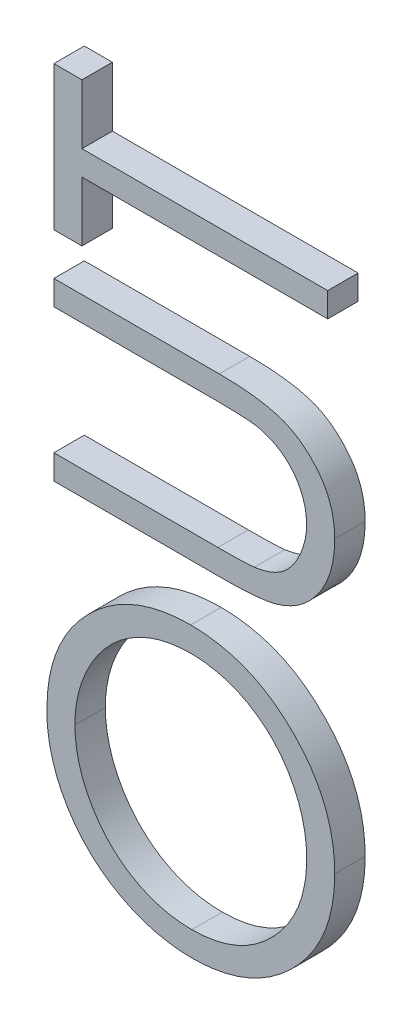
ISO-10303-21;
HEADER;
FILE_DESCRIPTION(('STEP AP214'),'2;1');
FILE_NAME('part.step','',(''),(''),'','','');
FILE_SCHEMA(('AUTOMOTIVE_DESIGN { 1 0 10303 214 1 1 1 1 }'));
ENDSEC;
DATA;
#1=APPLICATION_CONTEXT('core data for automotive mechanical design processes');
#2=APPLICATION_PROTOCOL_DEFINITION('international standard','automotive_design',2000,#1);
#3=PRODUCT_CONTEXT('',#1,'mechanical');
#4=PRODUCT('Part','Part','',(#3));
#5=PRODUCT_RELATED_PRODUCT_CATEGORY('part','',(#4));
#6=PRODUCT_DEFINITION_FORMATION('','',#4);
#7=PRODUCT_DEFINITION_CONTEXT('part definition',#1,'design');
#8=PRODUCT_DEFINITION('design','',#6,#7);
#9=PRODUCT_DEFINITION_SHAPE('','',#8);
#10=(LENGTH_UNIT() NAMED_UNIT(*) SI_UNIT(.MILLI.,.METRE.));
#11=(NAMED_UNIT(*) PLANE_ANGLE_UNIT() SI_UNIT($,.RADIAN.));
#12=(NAMED_UNIT(*) SI_UNIT($,.STERADIAN.) SOLID_ANGLE_UNIT());
#13=UNCERTAINTY_MEASURE_WITH_UNIT(LENGTH_MEASURE(1.E-05),#10,'distance_accuracy_value','');
#14=(GEOMETRIC_REPRESENTATION_CONTEXT(3) GLOBAL_UNCERTAINTY_ASSIGNED_CONTEXT((#13)) GLOBAL_UNIT_ASSIGNED_CONTEXT((#10,
#11,#12)) REPRESENTATION_CONTEXT('',''));
#15=CARTESIAN_POINT('',(0.,0.,0.));
#16=DIRECTION('',(0.,0.,1.));
#17=DIRECTION('',(1.,0.,0.));
#18=AXIS2_PLACEMENT_3D('',#15,#16,#17);
#19=CARTESIAN_POINT('',(114.230769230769,211.153846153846,10.));
#20=DIRECTION('',(1.,0.,0.));
#21=DIRECTION('',(0.,0.,-1.));
#22=AXIS2_PLACEMENT_3D('',#19,#20,#21);
#23=PLANE('',#22);
#24=DIRECTION('',(0.,-1.,0.));
#25=VECTOR('',#24,1.);
#26=CARTESIAN_POINT('',(114.230769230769,211.153846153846,0.));
#27=LINE('',#26,#25);
#28=CARTESIAN_POINT('',(114.230769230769,211.153846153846,0.));
#29=VERTEX_POINT('',#28);
#30=CARTESIAN_POINT('',(114.230769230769,191.538461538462,0.));
#31=VERTEX_POINT('',#30);
#32=EDGE_CURVE('E141',#29,#31,#27,.T.);
#33=ORIENTED_EDGE('',*,*,#32,.F.);
#34=DIRECTION('',(0.,0.,-1.));
#35=VECTOR('',#34,1.);
#36=CARTESIAN_POINT('',(114.230769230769,211.153846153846,10.));
#37=LINE('',#36,#35);
#38=CARTESIAN_POINT('',(114.230769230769,211.153846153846,10.));
#39=VERTEX_POINT('',#38);
#40=EDGE_CURVE('E12',#39,#29,#37,.T.);
#41=ORIENTED_EDGE('',*,*,#40,.F.);
#42=DIRECTION('',(0.,-1.,0.));
#43=VECTOR('',#42,1.);
#44=CARTESIAN_POINT('',(114.230769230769,211.153846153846,10.));
#45=LINE('',#44,#43);
#46=CARTESIAN_POINT('',(114.230769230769,191.538461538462,10.));
#47=VERTEX_POINT('',#46);
#48=EDGE_CURVE('E161',#39,#47,#45,.T.);
#49=ORIENTED_EDGE('',*,*,#48,.T.);
#50=DIRECTION('',(0.,0.,-1.));
#51=VECTOR('',#50,1.);
#52=CARTESIAN_POINT('',(114.230769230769,191.538461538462,10.));
#53=LINE('',#52,#51);
#54=EDGE_CURVE('E47',#47,#31,#53,.T.);
#55=ORIENTED_EDGE('',*,*,#54,.T.);
#56=EDGE_LOOP('',(#33,#41,#49,#55));
#57=FACE_BOUND('',#56,.T.);
#58=ADVANCED_FACE('F44',(#57),#23,.T.);
#59=CARTESIAN_POINT('',(195.,211.153846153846,10.));
#60=DIRECTION('',(0.,-1.,0.));
#61=DIRECTION('',(0.,0.,-1.));
#62=AXIS2_PLACEMENT_3D('',#59,#60,#61);
#63=PLANE('',#62);
#64=DIRECTION('',(-1.,0.,0.));
#65=VECTOR('',#64,1.);
#66=CARTESIAN_POINT('',(195.,211.153846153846,0.));
#67=LINE('',#66,#65);
#68=CARTESIAN_POINT('',(195.,211.153846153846,0.));
#69=VERTEX_POINT('',#68);
#70=EDGE_CURVE('E159',#69,#29,#67,.T.);
#71=ORIENTED_EDGE('',*,*,#70,.F.);
#72=DIRECTION('',(0.,0.,-1.));
#73=VECTOR('',#72,1.);
#74=CARTESIAN_POINT('',(195.,211.153846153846,10.));
#75=LINE('',#74,#73);
#76=CARTESIAN_POINT('',(195.,211.153846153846,10.));
#77=VERTEX_POINT('',#76);
#78=EDGE_CURVE('E53',#77,#69,#75,.T.);
#79=ORIENTED_EDGE('',*,*,#78,.F.);
#80=DIRECTION('',(-1.,0.,0.));
#81=VECTOR('',#80,1.);
#82=CARTESIAN_POINT('',(195.,211.153846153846,10.));
#83=LINE('',#82,#81);
#84=EDGE_CURVE('E131',#77,#39,#83,.T.);
#85=ORIENTED_EDGE('',*,*,#84,.T.);
#86=ORIENTED_EDGE('',*,*,#40,.T.);
#87=EDGE_LOOP('',(#71,#79,#85,#86));
#88=FACE_BOUND('',#87,.T.);
#89=ADVANCED_FACE('F173',(#88),#63,.T.);
#90=CARTESIAN_POINT('',(195.,219.230769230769,10.));
#91=DIRECTION('',(1.,0.,0.));
#92=DIRECTION('',(0.,0.,-1.));
#93=AXIS2_PLACEMENT_3D('',#90,#91,#92);
#94=PLANE('',#93);
#95=DIRECTION('',(0.,-1.,0.));
#96=VECTOR('',#95,1.);
#97=CARTESIAN_POINT('',(195.,219.230769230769,0.));
#98=LINE('',#97,#96);
#99=CARTESIAN_POINT('',(195.,219.230769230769,0.));
#100=VERTEX_POINT('',#99);
#101=EDGE_CURVE('E118',#100,#69,#98,.T.);
#102=ORIENTED_EDGE('',*,*,#101,.F.);
#103=DIRECTION('',(0.,0.,-1.));
#104=VECTOR('',#103,1.);
#105=CARTESIAN_POINT('',(195.,219.230769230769,10.));
#106=LINE('',#105,#104);
#107=CARTESIAN_POINT('',(195.,219.230769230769,10.));
#108=VERTEX_POINT('',#107);
#109=EDGE_CURVE('E113',#108,#100,#106,.T.);
#110=ORIENTED_EDGE('',*,*,#109,.F.);
#111=DIRECTION('',(0.,-1.,0.));
#112=VECTOR('',#111,1.);
#113=CARTESIAN_POINT('',(195.,219.230769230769,10.));
#114=LINE('',#113,#112);
#115=EDGE_CURVE('E116',#108,#77,#114,.T.);
#116=ORIENTED_EDGE('',*,*,#115,.T.);
#117=ORIENTED_EDGE('',*,*,#78,.T.);
#118=EDGE_LOOP('',(#102,#110,#116,#117));
#119=FACE_BOUND('',#118,.T.);
#120=ADVANCED_FACE('F115',(#119),#94,.T.);
#121=CARTESIAN_POINT('',(114.230769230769,219.230769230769,10.));
#122=DIRECTION('',(0.,1.,0.));
#123=DIRECTION('',(0.,0.,1.));
#124=AXIS2_PLACEMENT_3D('',#121,#122,#123);
#125=PLANE('',#124);
#126=DIRECTION('',(1.,0.,0.));
#127=VECTOR('',#126,1.);
#128=CARTESIAN_POINT('',(114.230769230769,219.230769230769,0.));
#129=LINE('',#128,#127);
#130=CARTESIAN_POINT('',(114.230769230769,219.230769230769,0.));
#131=VERTEX_POINT('',#130);
#132=EDGE_CURVE('E156',#131,#100,#129,.T.);
#133=ORIENTED_EDGE('',*,*,#132,.F.);
#134=DIRECTION('',(0.,0.,-1.));
#135=VECTOR('',#134,1.);
#136=CARTESIAN_POINT('',(114.230769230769,219.230769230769,10.));
#137=LINE('',#136,#135);
#138=CARTESIAN_POINT('',(114.230769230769,219.230769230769,10.));
#139=VERTEX_POINT('',#138);
#140=EDGE_CURVE('E123',#139,#131,#137,.T.);
#141=ORIENTED_EDGE('',*,*,#140,.F.);
#142=DIRECTION('',(1.,0.,0.));
#143=VECTOR('',#142,1.);
#144=CARTESIAN_POINT('',(114.230769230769,219.230769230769,10.));
#145=LINE('',#144,#143);
#146=EDGE_CURVE('E129',#139,#108,#145,.T.);
#147=ORIENTED_EDGE('',*,*,#146,.T.);
#148=ORIENTED_EDGE('',*,*,#109,.T.);
#149=EDGE_LOOP('',(#133,#141,#147,#148));
#150=FACE_BOUND('',#149,.T.);
#151=ADVANCED_FACE('F133',(#150),#125,.T.);
#152=CARTESIAN_POINT('',(114.230769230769,238.846153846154,10.));
#153=DIRECTION('',(1.,0.,0.));
#154=DIRECTION('',(0.,0.,-1.));
#155=AXIS2_PLACEMENT_3D('',#152,#153,#154);
#156=PLANE('',#155);
#157=DIRECTION('',(0.,-1.,0.));
#158=VECTOR('',#157,1.);
#159=CARTESIAN_POINT('',(114.230769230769,238.846153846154,0.));
#160=LINE('',#159,#158);
#161=CARTESIAN_POINT('',(114.230769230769,238.846153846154,0.));
#162=VERTEX_POINT('',#161);
#163=EDGE_CURVE('E153',#162,#131,#160,.T.);
#164=ORIENTED_EDGE('',*,*,#163,.F.);
#165=DIRECTION('',(0.,0.,-1.));
#166=VECTOR('',#165,1.);
#167=CARTESIAN_POINT('',(114.230769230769,238.846153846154,10.));
#168=LINE('',#167,#166);
#169=CARTESIAN_POINT('',(114.230769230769,238.846153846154,10.));
#170=VERTEX_POINT('',#169);
#171=EDGE_CURVE('E165',#170,#162,#168,.T.);
#172=ORIENTED_EDGE('',*,*,#171,.F.);
#173=DIRECTION('',(0.,-1.,0.));
#174=VECTOR('',#173,1.);
#175=CARTESIAN_POINT('',(114.230769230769,238.846153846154,10.));
#176=LINE('',#175,#174);
#177=EDGE_CURVE('E134',#170,#139,#176,.T.);
#178=ORIENTED_EDGE('',*,*,#177,.T.);
#179=ORIENTED_EDGE('',*,*,#140,.T.);
#180=EDGE_LOOP('',(#164,#172,#178,#179));
#181=FACE_BOUND('',#180,.T.);
#182=ADVANCED_FACE('F186',(#181),#156,.T.);
#183=CARTESIAN_POINT('',(105.,238.846153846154,10.));
#184=DIRECTION('',(0.,1.,0.));
#185=DIRECTION('',(0.,0.,1.));
#186=AXIS2_PLACEMENT_3D('',#183,#184,#185);
#187=PLANE('',#186);
#188=DIRECTION('',(1.,0.,0.));
#189=VECTOR('',#188,1.);
#190=CARTESIAN_POINT('',(105.,238.846153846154,0.));
#191=LINE('',#190,#189);
#192=CARTESIAN_POINT('',(105.,238.846153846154,0.));
#193=VERTEX_POINT('',#192);
#194=EDGE_CURVE('E150',#193,#162,#191,.T.);
#195=ORIENTED_EDGE('',*,*,#194,.F.);
#196=DIRECTION('',(0.,0.,-1.));
#197=VECTOR('',#196,1.);
#198=CARTESIAN_POINT('',(105.,238.846153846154,10.));
#199=LINE('',#198,#197);
#200=CARTESIAN_POINT('',(105.,238.846153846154,10.));
#201=VERTEX_POINT('',#200);
#202=EDGE_CURVE('E167',#201,#193,#199,.T.);
#203=ORIENTED_EDGE('',*,*,#202,.F.);
#204=DIRECTION('',(1.,0.,0.));
#205=VECTOR('',#204,1.);
#206=CARTESIAN_POINT('',(105.,238.846153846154,10.));
#207=LINE('',#206,#205);
#208=EDGE_CURVE('E136',#201,#170,#207,.T.);
#209=ORIENTED_EDGE('',*,*,#208,.T.);
#210=ORIENTED_EDGE('',*,*,#171,.T.);
#211=EDGE_LOOP('',(#195,#203,#209,#210));
#212=FACE_BOUND('',#211,.T.);
#213=ADVANCED_FACE('F189',(#212),#187,.T.);
#214=CARTESIAN_POINT('',(105.,191.538461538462,10.));
#215=DIRECTION('',(-1.,0.,0.));
#216=DIRECTION('',(0.,0.,1.));
#217=AXIS2_PLACEMENT_3D('',#214,#215,#216);
#218=PLANE('',#217);
#219=DIRECTION('',(0.,1.,0.));
#220=VECTOR('',#219,1.);
#221=CARTESIAN_POINT('',(105.,191.538461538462,0.));
#222=LINE('',#221,#220);
#223=CARTESIAN_POINT('',(105.,191.538461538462,0.));
#224=VERTEX_POINT('',#223);
#225=EDGE_CURVE('E147',#224,#193,#222,.T.);
#226=ORIENTED_EDGE('',*,*,#225,.F.);
#227=DIRECTION('',(0.,0.,-1.));
#228=VECTOR('',#227,1.);
#229=CARTESIAN_POINT('',(105.,191.538461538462,10.));
#230=LINE('',#229,#228);
#231=CARTESIAN_POINT('',(105.,191.538461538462,10.));
#232=VERTEX_POINT('',#231);
#233=EDGE_CURVE('E168',#232,#224,#230,.T.);
#234=ORIENTED_EDGE('',*,*,#233,.F.);
#235=DIRECTION('',(0.,1.,0.));
#236=VECTOR('',#235,1.);
#237=CARTESIAN_POINT('',(105.,191.538461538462,10.));
#238=LINE('',#237,#236);
#239=EDGE_CURVE('E282',#232,#201,#238,.T.);
#240=ORIENTED_EDGE('',*,*,#239,.T.);
#241=ORIENTED_EDGE('',*,*,#202,.T.);
#242=EDGE_LOOP('',(#226,#234,#240,#241));
#243=FACE_BOUND('',#242,.T.);
#244=ADVANCED_FACE('F193',(#243),#218,.T.);
#245=CARTESIAN_POINT('',(114.230769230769,191.538461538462,10.));
#246=DIRECTION('',(0.,-1.,0.));
#247=DIRECTION('',(0.,0.,-1.));
#248=AXIS2_PLACEMENT_3D('',#245,#246,#247);
#249=PLANE('',#248);
#250=DIRECTION('',(-1.,0.,0.));
#251=VECTOR('',#250,1.);
#252=CARTESIAN_POINT('',(114.230769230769,191.538461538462,0.));
#253=LINE('',#252,#251);
#254=EDGE_CURVE('E144',#31,#224,#253,.T.);
#255=ORIENTED_EDGE('',*,*,#254,.F.);
#256=ORIENTED_EDGE('',*,*,#54,.F.);
#257=DIRECTION('',(-1.,0.,0.));
#258=VECTOR('',#257,1.);
#259=CARTESIAN_POINT('',(114.230769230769,191.538461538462,10.));
#260=LINE('',#259,#258);
#261=EDGE_CURVE('E283',#47,#232,#260,.T.);
#262=ORIENTED_EDGE('',*,*,#261,.T.);
#263=ORIENTED_EDGE('',*,*,#233,.T.);
#264=EDGE_LOOP('',(#255,#256,#262,#263));
#265=FACE_BOUND('',#264,.T.);
#266=ADVANCED_FACE('F170',(#265),#249,.T.);
#267=CARTESIAN_POINT('',(0.,0.,10.));
#268=DIRECTION('',(0.,0.,-1.));
#269=DIRECTION('',(-1.,0.,0.));
#270=AXIS2_PLACEMENT_3D('',#267,#268,#269);
#271=PLANE('',#270);
#272=ORIENTED_EDGE('',*,*,#48,.F.);
#273=ORIENTED_EDGE('',*,*,#84,.F.);
#274=ORIENTED_EDGE('',*,*,#115,.F.);
#275=ORIENTED_EDGE('',*,*,#146,.F.);
#276=ORIENTED_EDGE('',*,*,#177,.F.);
#277=ORIENTED_EDGE('',*,*,#208,.F.);
#278=ORIENTED_EDGE('',*,*,#239,.F.);
#279=ORIENTED_EDGE('',*,*,#261,.F.);
#280=EDGE_LOOP('',(#272,#273,#274,#275,#276,#277,#278,#279));
#281=FACE_BOUND('',#280,.T.);
#282=ADVANCED_FACE('F127',(#281),#271,.F.);
#283=CARTESIAN_POINT('',(0.,0.,0.));
#284=DIRECTION('',(0.,0.,-1.));
#285=DIRECTION('',(-1.,0.,0.));
#286=AXIS2_PLACEMENT_3D('',#283,#284,#285);
#287=PLANE('',#286);
#288=ORIENTED_EDGE('',*,*,#32,.T.);
#289=ORIENTED_EDGE('',*,*,#254,.T.);
#290=ORIENTED_EDGE('',*,*,#225,.T.);
#291=ORIENTED_EDGE('',*,*,#194,.T.);
#292=ORIENTED_EDGE('',*,*,#163,.T.);
#293=ORIENTED_EDGE('',*,*,#132,.T.);
#294=ORIENTED_EDGE('',*,*,#101,.T.);
#295=ORIENTED_EDGE('',*,*,#70,.T.);
#296=EDGE_LOOP('',(#288,#289,#290,#291,#292,#293,#294,#295));
#297=FACE_BOUND('',#296,.T.);
#298=ADVANCED_FACE('F172',(#297),#287,.T.);
#299=CLOSED_SHELL('',(#58,#89,#120,#151,#182,#213,#244,#266,#282,#298));
#300=MANIFOLD_SOLID_BREP('B2',#299);
#301=CARTESIAN_POINT('',(159.356971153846,120.,10.));
#302=DIRECTION('',(0.,-1.,0.));
#303=DIRECTION('',(0.,0.,-1.));
#304=AXIS2_PLACEMENT_3D('',#301,#302,#303);
#305=PLANE('',#304);
#306=DIRECTION('',(-1.,0.,0.));
#307=VECTOR('',#306,1.);
#308=CARTESIAN_POINT('',(159.356971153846,120.,0.));
#309=LINE('',#308,#307);
#310=CARTESIAN_POINT('',(159.356971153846,120.,0.));
#311=VERTEX_POINT('',#310);
#312=CARTESIAN_POINT('',(105.,120.,0.));
#313=VERTEX_POINT('',#312);
#314=EDGE_CURVE('E506',#311,#313,#309,.T.);
#315=ORIENTED_EDGE('',*,*,#314,.F.);
#316=DIRECTION('',(0.,0.,-1.));
#317=VECTOR('',#316,1.);
#318=CARTESIAN_POINT('',(159.356971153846,120.,10.));
#319=LINE('',#318,#317);
#320=CARTESIAN_POINT('',(159.356971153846,120.,10.));
#321=VERTEX_POINT('',#320);
#322=EDGE_CURVE('E42',#321,#311,#319,.T.);
#323=ORIENTED_EDGE('',*,*,#322,.F.);
#324=DIRECTION('',(-1.,0.,0.));
#325=VECTOR('',#324,1.);
#326=CARTESIAN_POINT('',(159.356971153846,120.,10.));
#327=LINE('',#326,#325);
#328=CARTESIAN_POINT('',(105.,120.,10.));
#329=VERTEX_POINT('',#328);
#330=EDGE_CURVE('E532',#321,#329,#327,.T.);
#331=ORIENTED_EDGE('',*,*,#330,.T.);
#332=DIRECTION('',(0.,0.,-1.));
#333=VECTOR('',#332,1.);
#334=CARTESIAN_POINT('',(105.,120.,10.));
#335=LINE('',#334,#333);
#336=EDGE_CURVE('E302',#329,#313,#335,.T.);
#337=ORIENTED_EDGE('',*,*,#336,.T.);
#338=EDGE_LOOP('',(#315,#323,#331,#337));
#339=FACE_BOUND('',#338,.T.);
#340=ADVANCED_FACE('F299',(#339),#305,.T.);
#341=CARTESIAN_POINT('',(178.323317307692,121.604567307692,10.));
#342=CARTESIAN_POINT('',(177.844193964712,121.47144038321,10.));
#343=CARTESIAN_POINT('',(176.804964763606,121.182685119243,10.));
#344=CARTESIAN_POINT('',(175.085026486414,120.873463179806,10.));
#345=CARTESIAN_POINT('',(173.104642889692,120.613515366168,10.));
#346=CARTESIAN_POINT('',(170.863678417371,120.369086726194,10.));
#347=CARTESIAN_POINT('',(168.360396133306,120.224856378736,10.));
#348=CARTESIAN_POINT('',(165.595881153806,120.098407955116,10.));
#349=CARTESIAN_POINT('',(162.566790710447,119.999109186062,10.));
#350=CARTESIAN_POINT('',(160.456817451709,119.999694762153,10.));
#351=CARTESIAN_POINT('',(159.356971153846,120.,10.));
#352=B_SPLINE_CURVE_WITH_KNOTS('',3,(#341,#342,#343,#344,#345,#346,#347,#348,#349,#350,#351),
.UNSPECIFIED.,.F.,.F.,(4,1,1,1,1,1,1,1,4),(0.,0.0781298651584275,0.169465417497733,
0.274335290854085,0.392110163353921,0.52368732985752,0.668365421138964,0.827131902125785,1.),.UNSPECIFIED.);
#353=DIRECTION('',(0.,0.,-1.));
#354=VECTOR('',#353,1.);
#355=SURFACE_OF_LINEAR_EXTRUSION('',#352,#354);
#356=CARTESIAN_POINT('',(178.323317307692,121.604567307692,0.));
#357=CARTESIAN_POINT('',(177.844193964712,121.47144038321,0.));
#358=CARTESIAN_POINT('',(176.804964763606,121.182685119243,0.));
#359=CARTESIAN_POINT('',(175.085026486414,120.873463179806,0.));
#360=CARTESIAN_POINT('',(173.104642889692,120.613515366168,0.));
#361=CARTESIAN_POINT('',(170.863678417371,120.369086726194,0.));
#362=CARTESIAN_POINT('',(168.360396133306,120.224856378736,0.));
#363=CARTESIAN_POINT('',(165.595881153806,120.098407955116,0.));
#364=CARTESIAN_POINT('',(162.566790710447,119.999109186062,0.));
#365=CARTESIAN_POINT('',(160.456817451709,119.999694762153,0.));
#366=CARTESIAN_POINT('',(159.356971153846,120.,0.));
#367=B_SPLINE_CURVE_WITH_KNOTS('',3,(#356,#357,#358,#359,#360,#361,#362,#363,#364,#365,#366),
.UNSPECIFIED.,.F.,.F.,(4,1,1,1,1,1,1,1,4),(0.,0.0781298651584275,0.169465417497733,
0.274335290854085,0.392110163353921,0.52368732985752,0.668365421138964,0.827131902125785,1.),.UNSPECIFIED.);
#368=CARTESIAN_POINT('',(178.323317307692,121.604567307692,0.));
#369=VERTEX_POINT('',#368);
#370=EDGE_CURVE('E531',#369,#311,#367,.T.);
#371=ORIENTED_EDGE('',*,*,#370,.F.);
#372=DIRECTION('',(0.,0.,-1.));
#373=VECTOR('',#372,1.);
#374=CARTESIAN_POINT('',(178.323317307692,121.604567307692,10.));
#375=LINE('',#374,#373);
#376=CARTESIAN_POINT('',(178.323317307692,121.604567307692,10.));
#377=VERTEX_POINT('',#376);
#378=EDGE_CURVE('E308',#377,#369,#375,.T.);
#379=ORIENTED_EDGE('',*,*,#378,.F.);
#380=EDGE_CURVE('E416',#377,#321,#352,.T.);
#381=ORIENTED_EDGE('',*,*,#380,.T.);
#382=ORIENTED_EDGE('',*,*,#322,.T.);
#383=EDGE_LOOP('',(#371,#379,#381,#382));
#384=FACE_BOUND('',#383,.T.);
#385=ADVANCED_FACE('F511',(#384),#355,.T.);
#386=CARTESIAN_POINT('',(197.307692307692,149.729567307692,10.));
#387=CARTESIAN_POINT('',(197.287526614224,148.863784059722,10.));
#388=CARTESIAN_POINT('',(197.247961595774,147.165120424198,10.));
#389=CARTESIAN_POINT('',(197.020892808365,144.662231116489,10.));
#390=CARTESIAN_POINT('',(196.594284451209,142.262396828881,10.));
#391=CARTESIAN_POINT('',(196.047565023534,139.942195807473,10.));
#392=CARTESIAN_POINT('',(195.30584921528,137.724043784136,10.));
#393=CARTESIAN_POINT('',(194.39447831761,135.608594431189,10.));
#394=CARTESIAN_POINT('',(193.354009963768,133.571557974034,10.));
#395=CARTESIAN_POINT('',(192.124532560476,131.65882836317,10.));
#396=CARTESIAN_POINT('',(190.783870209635,129.854714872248,10.));
#397=CARTESIAN_POINT('',(189.311299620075,128.215188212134,10.));
#398=CARTESIAN_POINT('',(187.762903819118,126.698628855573,10.));
#399=CARTESIAN_POINT('',(186.080377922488,125.371883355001,10.));
#400=CARTESIAN_POINT('',(184.298164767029,124.184769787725,10.));
#401=CARTESIAN_POINT('',(182.407881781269,123.163446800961,10.));
#402=CARTESIAN_POINT('',(180.412062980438,122.286166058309,10.));
#403=CARTESIAN_POINT('',(179.024684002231,121.833437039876,10.));
#404=CARTESIAN_POINT('',(178.323317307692,121.604567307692,10.));
#405=B_SPLINE_CURVE_WITH_KNOTS('',3,(#386,#387,#388,#389,#390,#391,#392,#393,#394,#395,#396,
#397,#398,#399,#400,#401,#402,#403,#404),.UNSPECIFIED.,.F.,.F.,(4,1,1,1,1,1,1,1,1,1,1,1,1,1,1,1,
4),(0.,0.0711836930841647,0.139662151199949,0.206343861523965,0.271408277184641,
0.33546138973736,0.39832023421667,0.460631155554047,0.523264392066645,0.585018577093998,
0.645205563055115,0.704252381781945,0.762967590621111,0.821064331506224,0.880088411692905,
0.939380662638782,1.),.UNSPECIFIED.);
#406=DIRECTION('',(0.,0.,-1.));
#407=VECTOR('',#406,1.);
#408=SURFACE_OF_LINEAR_EXTRUSION('',#405,#407);
#409=CARTESIAN_POINT('',(197.307692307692,149.729567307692,0.));
#410=CARTESIAN_POINT('',(197.287526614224,148.863784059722,0.));
#411=CARTESIAN_POINT('',(197.247961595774,147.165120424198,0.));
#412=CARTESIAN_POINT('',(197.020892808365,144.662231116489,0.));
#413=CARTESIAN_POINT('',(196.594284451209,142.262396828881,0.));
#414=CARTESIAN_POINT('',(196.047565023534,139.942195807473,0.));
#415=CARTESIAN_POINT('',(195.30584921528,137.724043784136,0.));
#416=CARTESIAN_POINT('',(194.39447831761,135.608594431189,0.));
#417=CARTESIAN_POINT('',(193.354009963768,133.571557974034,0.));
#418=CARTESIAN_POINT('',(192.124532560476,131.65882836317,0.));
#419=CARTESIAN_POINT('',(190.783870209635,129.854714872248,0.));
#420=CARTESIAN_POINT('',(189.311299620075,128.215188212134,0.));
#421=CARTESIAN_POINT('',(187.762903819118,126.698628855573,0.));
#422=CARTESIAN_POINT('',(186.080377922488,125.371883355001,0.));
#423=CARTESIAN_POINT('',(184.298164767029,124.184769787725,0.));
#424=CARTESIAN_POINT('',(182.407881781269,123.163446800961,0.));
#425=CARTESIAN_POINT('',(180.412062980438,122.286166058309,0.));
#426=CARTESIAN_POINT('',(179.024684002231,121.833437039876,0.));
#427=CARTESIAN_POINT('',(178.323317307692,121.604567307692,0.));
#428=B_SPLINE_CURVE_WITH_KNOTS('',3,(#409,#410,#411,#412,#413,#414,#415,#416,#417,#418,#419,
#420,#421,#422,#423,#424,#425,#426,#427),.UNSPECIFIED.,.F.,.F.,(4,1,1,1,1,1,1,1,1,1,1,1,1,1,1,1,
4),(0.,0.0711836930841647,0.139662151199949,0.206343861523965,0.271408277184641,
0.33546138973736,0.39832023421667,0.460631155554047,0.523264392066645,0.585018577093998,
0.645205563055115,0.704252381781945,0.762967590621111,0.821064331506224,0.880088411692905,
0.939380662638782,1.),.UNSPECIFIED.);
#429=CARTESIAN_POINT('',(197.307692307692,149.729567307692,0.));
#430=VERTEX_POINT('',#429);
#431=EDGE_CURVE('E403',#430,#369,#428,.T.);
#432=ORIENTED_EDGE('',*,*,#431,.F.);
#433=DIRECTION('',(0.,0.,-1.));
#434=VECTOR('',#433,1.);
#435=CARTESIAN_POINT('',(197.307692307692,149.729567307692,10.));
#436=LINE('',#435,#434);
#437=CARTESIAN_POINT('',(197.307692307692,149.729567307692,10.));
#438=VERTEX_POINT('',#437);
#439=EDGE_CURVE('E398',#438,#430,#436,.T.);
#440=ORIENTED_EDGE('',*,*,#439,.F.);
#441=EDGE_CURVE('E401',#438,#377,#405,.T.);
#442=ORIENTED_EDGE('',*,*,#441,.T.);
#443=ORIENTED_EDGE('',*,*,#378,.T.);
#444=EDGE_LOOP('',(#432,#440,#442,#443));
#445=FACE_BOUND('',#444,.T.);
#446=ADVANCED_FACE('F400',(#445),#408,.T.);
#447=CARTESIAN_POINT('',(159.356971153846,177.692307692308,10.));
#448=CARTESIAN_POINT('',(160.336643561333,177.685772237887,10.));
#449=CARTESIAN_POINT('',(162.248533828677,177.67301790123,10.));
#450=CARTESIAN_POINT('',(165.050142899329,177.562444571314,10.));
#451=CARTESIAN_POINT('',(167.707781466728,177.38607606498,10.));
#452=CARTESIAN_POINT('',(170.221861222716,177.137110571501,10.));
#453=CARTESIAN_POINT('',(172.583198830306,176.806478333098,10.));
#454=CARTESIAN_POINT('',(174.807347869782,176.442196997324,10.));
#455=CARTESIAN_POINT('',(176.882045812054,175.970178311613,10.));
#456=CARTESIAN_POINT('',(178.831229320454,175.422923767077,10.));
#457=CARTESIAN_POINT('',(180.69604583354,174.806242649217,10.));
#458=CARTESIAN_POINT('',(182.462382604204,173.993496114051,10.));
#459=CARTESIAN_POINT('',(184.182117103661,173.081778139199,10.));
#460=CARTESIAN_POINT('',(185.835992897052,172.009189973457,10.));
#461=CARTESIAN_POINT('',(187.413502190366,170.775223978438,10.));
#462=CARTESIAN_POINT('',(188.955480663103,169.427154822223,10.));
#463=CARTESIAN_POINT('',(190.415973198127,167.91746695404,10.));
#464=CARTESIAN_POINT('',(191.812992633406,166.290751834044,10.));
#465=CARTESIAN_POINT('',(193.11222106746,164.557946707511,10.));
#466=CARTESIAN_POINT('',(194.242844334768,162.707862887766,10.));
#467=CARTESIAN_POINT('',(195.163478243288,160.750714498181,10.));
#468=CARTESIAN_POINT('',(195.980558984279,158.732845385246,10.));
#469=CARTESIAN_POINT('',(196.561319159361,156.605875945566,10.));
#470=CARTESIAN_POINT('',(197.002897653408,154.396300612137,10.));
#471=CARTESIAN_POINT('',(197.251695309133,152.091013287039,10.));
#472=CARTESIAN_POINT('',(197.28886840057,150.523389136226,10.));
#473=CARTESIAN_POINT('',(197.307692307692,149.729567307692,10.));
#474=B_SPLINE_CURVE_WITH_KNOTS('',3,(#447,#448,#449,#450,#451,#452,#453,#454,#455,#456,#457,
#458,#459,#460,#461,#462,#463,#464,#465,#466,#467,#468,#469,#470,#471,#472,#473),.UNSPECIFIED.,
.F.,.F.,(4,1,1,1,1,1,1,1,1,1,1,1,1,1,1,1,1,1,1,1,1,1,1,1,4),(0.,0.0548627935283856,
0.10706807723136,0.156991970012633,0.204009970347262,0.248513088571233,0.290508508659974,
0.33018932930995,0.367589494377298,0.403882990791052,0.440037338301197,0.476326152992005,
0.512826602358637,0.550255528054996,0.588406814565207,0.62743863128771,0.667776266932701,
0.708432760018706,0.748605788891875,0.788947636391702,0.829446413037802,0.870359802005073,
0.912206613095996,0.955542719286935,1.),.UNSPECIFIED.);
#475=DIRECTION('',(0.,0.,-1.));
#476=VECTOR('',#475,1.);
#477=SURFACE_OF_LINEAR_EXTRUSION('',#474,#476);
#478=CARTESIAN_POINT('',(159.356971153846,177.692307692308,0.));
#479=CARTESIAN_POINT('',(160.336643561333,177.685772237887,0.));
#480=CARTESIAN_POINT('',(162.248533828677,177.67301790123,0.));
#481=CARTESIAN_POINT('',(165.050142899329,177.562444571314,0.));
#482=CARTESIAN_POINT('',(167.707781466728,177.38607606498,0.));
#483=CARTESIAN_POINT('',(170.221861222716,177.137110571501,0.));
#484=CARTESIAN_POINT('',(172.583198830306,176.806478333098,0.));
#485=CARTESIAN_POINT('',(174.807347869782,176.442196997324,0.));
#486=CARTESIAN_POINT('',(176.882045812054,175.970178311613,0.));
#487=CARTESIAN_POINT('',(178.831229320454,175.422923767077,0.));
#488=CARTESIAN_POINT('',(180.69604583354,174.806242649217,0.));
#489=CARTESIAN_POINT('',(182.462382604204,173.993496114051,0.));
#490=CARTESIAN_POINT('',(184.182117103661,173.081778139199,0.));
#491=CARTESIAN_POINT('',(185.835992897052,172.009189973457,0.));
#492=CARTESIAN_POINT('',(187.413502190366,170.775223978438,0.));
#493=CARTESIAN_POINT('',(188.955480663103,169.427154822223,0.));
#494=CARTESIAN_POINT('',(190.415973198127,167.91746695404,0.));
#495=CARTESIAN_POINT('',(191.812992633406,166.290751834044,0.));
#496=CARTESIAN_POINT('',(193.11222106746,164.557946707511,0.));
#497=CARTESIAN_POINT('',(194.242844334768,162.707862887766,0.));
#498=CARTESIAN_POINT('',(195.163478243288,160.750714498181,0.));
#499=CARTESIAN_POINT('',(195.980558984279,158.732845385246,0.));
#500=CARTESIAN_POINT('',(196.561319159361,156.605875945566,0.));
#501=CARTESIAN_POINT('',(197.002897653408,154.396300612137,0.));
#502=CARTESIAN_POINT('',(197.251695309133,152.091013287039,0.));
#503=CARTESIAN_POINT('',(197.28886840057,150.523389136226,0.));
#504=CARTESIAN_POINT('',(197.307692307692,149.729567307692,0.));
#505=B_SPLINE_CURVE_WITH_KNOTS('',3,(#478,#479,#480,#481,#482,#483,#484,#485,#486,#487,#488,
#489,#490,#491,#492,#493,#494,#495,#496,#497,#498,#499,#500,#501,#502,#503,#504),.UNSPECIFIED.,
.F.,.F.,(4,1,1,1,1,1,1,1,1,1,1,1,1,1,1,1,1,1,1,1,1,1,1,1,4),(0.,0.0548627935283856,
0.10706807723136,0.156991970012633,0.204009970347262,0.248513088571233,0.290508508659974,
0.33018932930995,0.367589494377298,0.403882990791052,0.440037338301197,0.476326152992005,
0.512826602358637,0.550255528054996,0.588406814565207,0.62743863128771,0.667776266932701,
0.708432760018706,0.748605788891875,0.788947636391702,0.829446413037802,0.870359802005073,
0.912206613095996,0.955542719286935,1.),.UNSPECIFIED.);
#506=CARTESIAN_POINT('',(159.356971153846,177.692307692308,0.));
#507=VERTEX_POINT('',#506);
#508=EDGE_CURVE('E536',#507,#430,#505,.T.);
#509=ORIENTED_EDGE('',*,*,#508,.F.);
#510=DIRECTION('',(0.,0.,-1.));
#511=VECTOR('',#510,1.);
#512=CARTESIAN_POINT('',(159.356971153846,177.692307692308,10.));
#513=LINE('',#512,#511);
#514=CARTESIAN_POINT('',(159.356971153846,177.692307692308,10.));
#515=VERTEX_POINT('',#514);
#516=EDGE_CURVE('E408',#515,#507,#513,.T.);
#517=ORIENTED_EDGE('',*,*,#516,.F.);
#518=EDGE_CURVE('E414',#515,#438,#474,.T.);
#519=ORIENTED_EDGE('',*,*,#518,.T.);
#520=ORIENTED_EDGE('',*,*,#439,.T.);
#521=EDGE_LOOP('',(#509,#517,#519,#520));
#522=FACE_BOUND('',#521,.T.);
#523=ADVANCED_FACE('F418',(#522),#477,.T.);
#524=CARTESIAN_POINT('',(105.,177.692307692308,10.));
#525=DIRECTION('',(0.,1.,0.));
#526=DIRECTION('',(0.,0.,1.));
#527=AXIS2_PLACEMENT_3D('',#524,#525,#526);
#528=PLANE('',#527);
#529=DIRECTION('',(1.,0.,0.));
#530=VECTOR('',#529,1.);
#531=CARTESIAN_POINT('',(105.,177.692307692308,0.));
#532=LINE('',#531,#530);
#533=CARTESIAN_POINT('',(105.,177.692307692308,0.));
#534=VERTEX_POINT('',#533);
#535=EDGE_CURVE('E549',#534,#507,#532,.T.);
#536=ORIENTED_EDGE('',*,*,#535,.F.);
#537=DIRECTION('',(0.,0.,-1.));
#538=VECTOR('',#537,1.);
#539=CARTESIAN_POINT('',(105.,177.692307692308,10.));
#540=LINE('',#539,#538);
#541=CARTESIAN_POINT('',(105.,177.692307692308,10.));
#542=VERTEX_POINT('',#541);
#543=EDGE_CURVE('E478',#542,#534,#540,.T.);
#544=ORIENTED_EDGE('',*,*,#543,.F.);
#545=DIRECTION('',(1.,0.,0.));
#546=VECTOR('',#545,1.);
#547=CARTESIAN_POINT('',(105.,177.692307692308,10.));
#548=LINE('',#547,#546);
#549=EDGE_CURVE('E419',#542,#515,#548,.T.);
#550=ORIENTED_EDGE('',*,*,#549,.T.);
#551=ORIENTED_EDGE('',*,*,#516,.T.);
#552=EDGE_LOOP('',(#536,#544,#550,#551));
#553=FACE_BOUND('',#552,.T.);
#554=ADVANCED_FACE('F438',(#553),#528,.T.);
#555=CARTESIAN_POINT('',(105.,169.615384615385,10.));
#556=DIRECTION('',(-1.,0.,0.));
#557=DIRECTION('',(0.,0.,1.));
#558=AXIS2_PLACEMENT_3D('',#555,#556,#557);
#559=PLANE('',#558);
#560=DIRECTION('',(0.,1.,0.));
#561=VECTOR('',#560,1.);
#562=CARTESIAN_POINT('',(105.,169.615384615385,0.));
#563=LINE('',#562,#561);
#564=CARTESIAN_POINT('',(105.,169.615384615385,0.));
#565=VERTEX_POINT('',#564);
#566=EDGE_CURVE('E551',#565,#534,#563,.T.);
#567=ORIENTED_EDGE('',*,*,#566,.F.);
#568=DIRECTION('',(0.,0.,-1.));
#569=VECTOR('',#568,1.);
#570=CARTESIAN_POINT('',(105.,169.615384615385,10.));
#571=LINE('',#570,#569);
#572=CARTESIAN_POINT('',(105.,169.615384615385,10.));
#573=VERTEX_POINT('',#572);
#574=EDGE_CURVE('E480',#573,#565,#571,.T.);
#575=ORIENTED_EDGE('',*,*,#574,.F.);
#576=DIRECTION('',(0.,1.,0.));
#577=VECTOR('',#576,1.);
#578=CARTESIAN_POINT('',(105.,169.615384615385,10.));
#579=LINE('',#578,#577);
#580=EDGE_CURVE('E421',#573,#542,#579,.T.);
#581=ORIENTED_EDGE('',*,*,#580,.T.);
#582=ORIENTED_EDGE('',*,*,#543,.T.);
#583=EDGE_LOOP('',(#567,#575,#581,#582));
#584=FACE_BOUND('',#583,.T.);
#585=ADVANCED_FACE('F442',(#584),#559,.T.);
#586=CARTESIAN_POINT('',(158.924278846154,169.615384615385,10.));
#587=DIRECTION('',(0.,-1.,0.));
#588=DIRECTION('',(0.,0.,-1.));
#589=AXIS2_PLACEMENT_3D('',#586,#587,#588);
#590=PLANE('',#589);
#591=DIRECTION('',(-1.,0.,0.));
#592=VECTOR('',#591,1.);
#593=CARTESIAN_POINT('',(158.924278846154,169.615384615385,0.));
#594=LINE('',#593,#592);
#595=CARTESIAN_POINT('',(158.924278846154,169.615384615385,0.));
#596=VERTEX_POINT('',#595);
#597=EDGE_CURVE('E486',#596,#565,#594,.T.);
#598=ORIENTED_EDGE('',*,*,#597,.F.);
#599=DIRECTION('',(0.,0.,-1.));
#600=VECTOR('',#599,1.);
#601=CARTESIAN_POINT('',(158.924278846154,169.615384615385,10.));
#602=LINE('',#601,#600);
#603=CARTESIAN_POINT('',(158.924278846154,169.615384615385,10.));
#604=VERTEX_POINT('',#603);
#605=EDGE_CURVE('E484',#604,#596,#602,.T.);
#606=ORIENTED_EDGE('',*,*,#605,.F.);
#607=DIRECTION('',(-1.,0.,0.));
#608=VECTOR('',#607,1.);
#609=CARTESIAN_POINT('',(158.924278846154,169.615384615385,10.));
#610=LINE('',#609,#608);
#611=EDGE_CURVE('E465',#604,#573,#610,.T.);
#612=ORIENTED_EDGE('',*,*,#611,.T.);
#613=ORIENTED_EDGE('',*,*,#574,.T.);
#614=EDGE_LOOP('',(#598,#606,#612,#613));
#615=FACE_BOUND('',#614,.T.);
#616=ADVANCED_FACE('F446',(#615),#590,.T.);
#617=CARTESIAN_POINT('',(172.896634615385,168.695913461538,10.));
#618=CARTESIAN_POINT('',(172.579099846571,168.773059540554,10.));
#619=CARTESIAN_POINT('',(171.871504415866,168.944972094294,10.));
#620=CARTESIAN_POINT('',(170.675242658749,169.105610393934,10.));
#621=CARTESIAN_POINT('',(169.263801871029,169.272921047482,10.));
#622=CARTESIAN_POINT('',(167.627040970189,169.389009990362,10.));
#623=CARTESIAN_POINT('',(165.770444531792,169.502184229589,10.));
#624=CARTESIAN_POINT('',(163.684340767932,169.569891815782,10.));
#625=CARTESIAN_POINT('',(161.376304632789,169.601186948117,10.));
#626=CARTESIAN_POINT('',(159.765634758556,169.610513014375,10.));
#627=CARTESIAN_POINT('',(158.924278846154,169.615384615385,10.));
#628=B_SPLINE_CURVE_WITH_KNOTS('',3,(#617,#618,#619,#620,#621,#622,#623,#624,#625,#626,#627),
.UNSPECIFIED.,.F.,.F.,(4,1,1,1,1,1,1,1,4),(0.,0.0698351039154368,0.155620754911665,
0.257801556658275,0.373811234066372,0.506402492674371,0.655564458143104,0.820079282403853,1.),.UNSPECIFIED.);
#629=DIRECTION('',(0.,0.,-1.));
#630=VECTOR('',#629,1.);
#631=SURFACE_OF_LINEAR_EXTRUSION('',#628,#630);
#632=CARTESIAN_POINT('',(172.896634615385,168.695913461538,0.));
#633=CARTESIAN_POINT('',(172.579099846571,168.773059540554,0.));
#634=CARTESIAN_POINT('',(171.871504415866,168.944972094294,0.));
#635=CARTESIAN_POINT('',(170.675242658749,169.105610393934,0.));
#636=CARTESIAN_POINT('',(169.263801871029,169.272921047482,0.));
#637=CARTESIAN_POINT('',(167.627040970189,169.389009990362,0.));
#638=CARTESIAN_POINT('',(165.770444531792,169.502184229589,0.));
#639=CARTESIAN_POINT('',(163.684340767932,169.569891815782,0.));
#640=CARTESIAN_POINT('',(161.376304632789,169.601186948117,0.));
#641=CARTESIAN_POINT('',(159.765634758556,169.610513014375,0.));
#642=CARTESIAN_POINT('',(158.924278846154,169.615384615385,0.));
#643=B_SPLINE_CURVE_WITH_KNOTS('',3,(#632,#633,#634,#635,#636,#637,#638,#639,#640,#641,#642),
.UNSPECIFIED.,.F.,.F.,(4,1,1,1,1,1,1,1,4),(0.,0.0698351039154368,0.155620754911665,
0.257801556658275,0.373811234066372,0.506402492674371,0.655564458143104,0.820079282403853,1.),.UNSPECIFIED.);
#644=CARTESIAN_POINT('',(172.896634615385,168.695913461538,0.));
#645=VERTEX_POINT('',#644);
#646=EDGE_CURVE('E561',#645,#596,#643,.T.);
#647=ORIENTED_EDGE('',*,*,#646,.F.);
#648=DIRECTION('',(0.,0.,-1.));
#649=VECTOR('',#648,1.);
#650=CARTESIAN_POINT('',(172.896634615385,168.695913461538,10.));
#651=LINE('',#650,#649);
#652=CARTESIAN_POINT('',(172.896634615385,168.695913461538,10.));
#653=VERTEX_POINT('',#652);
#654=EDGE_CURVE('E489',#653,#645,#651,.T.);
#655=ORIENTED_EDGE('',*,*,#654,.F.);
#656=EDGE_CURVE('E459',#653,#604,#628,.T.);
#657=ORIENTED_EDGE('',*,*,#656,.T.);
#658=ORIENTED_EDGE('',*,*,#605,.T.);
#659=EDGE_LOOP('',(#647,#655,#657,#658));
#660=FACE_BOUND('',#659,.T.);
#661=ADVANCED_FACE('F450',(#660),#631,.T.);
#662=CARTESIAN_POINT('',(188.076923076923,149.278846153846,10.));
#663=CARTESIAN_POINT('',(188.04946285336,150.013149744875,10.));
#664=CARTESIAN_POINT('',(187.994701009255,151.47751578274,10.));
#665=CARTESIAN_POINT('',(187.651413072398,153.652148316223,10.));
#666=CARTESIAN_POINT('',(187.04492201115,155.776808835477,10.));
#667=CARTESIAN_POINT('',(186.218770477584,157.834806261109,10.));
#668=CARTESIAN_POINT('',(185.202825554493,159.792694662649,10.));
#669=CARTESIAN_POINT('',(183.98574005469,161.600276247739,10.));
#670=CARTESIAN_POINT('',(182.568071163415,163.220162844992,10.));
#671=CARTESIAN_POINT('',(180.996902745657,164.698399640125,10.));
#672=CARTESIAN_POINT('',(179.226377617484,165.978075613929,10.));
#673=CARTESIAN_POINT('',(177.299209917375,167.109509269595,10.));
#674=CARTESIAN_POINT('',(175.164012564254,168.008075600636,10.));
#675=CARTESIAN_POINT('',(173.664350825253,168.463017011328,10.));
#676=CARTESIAN_POINT('',(172.896634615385,168.695913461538,10.));
#677=B_SPLINE_CURVE_WITH_KNOTS('',3,(#662,#663,#664,#665,#666,#667,#668,#669,#670,#671,#672,
#673,#674,#675,#676),.UNSPECIFIED.,.F.,.F.,(4,1,1,1,1,1,1,1,1,1,1,1,4),(0.,0.0828932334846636,
0.165307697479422,0.247769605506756,0.331787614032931,0.41522583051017,0.496314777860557,
0.577102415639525,0.657736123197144,0.739277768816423,0.823164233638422,0.90947312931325,1.),.UNSPECIFIED.);
#678=DIRECTION('',(0.,0.,-1.));
#679=VECTOR('',#678,1.);
#680=SURFACE_OF_LINEAR_EXTRUSION('',#677,#679);
#681=CARTESIAN_POINT('',(188.076923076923,149.278846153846,0.));
#682=CARTESIAN_POINT('',(188.04946285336,150.013149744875,0.));
#683=CARTESIAN_POINT('',(187.994701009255,151.47751578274,0.));
#684=CARTESIAN_POINT('',(187.651413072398,153.652148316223,0.));
#685=CARTESIAN_POINT('',(187.04492201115,155.776808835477,0.));
#686=CARTESIAN_POINT('',(186.218770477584,157.834806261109,0.));
#687=CARTESIAN_POINT('',(185.202825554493,159.792694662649,0.));
#688=CARTESIAN_POINT('',(183.98574005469,161.600276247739,0.));
#689=CARTESIAN_POINT('',(182.568071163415,163.220162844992,0.));
#690=CARTESIAN_POINT('',(180.996902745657,164.698399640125,0.));
#691=CARTESIAN_POINT('',(179.226377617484,165.978075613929,0.));
#692=CARTESIAN_POINT('',(177.299209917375,167.109509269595,0.));
#693=CARTESIAN_POINT('',(175.164012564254,168.008075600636,0.));
#694=CARTESIAN_POINT('',(173.664350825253,168.463017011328,0.));
#695=CARTESIAN_POINT('',(172.896634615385,168.695913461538,0.));
#696=B_SPLINE_CURVE_WITH_KNOTS('',3,(#681,#682,#683,#684,#685,#686,#687,#688,#689,#690,#691,
#692,#693,#694,#695),.UNSPECIFIED.,.F.,.F.,(4,1,1,1,1,1,1,1,1,1,1,1,4),(0.,0.0828932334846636,
0.165307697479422,0.247769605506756,0.331787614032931,0.41522583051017,0.496314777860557,
0.577102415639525,0.657736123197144,0.739277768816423,0.823164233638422,0.90947312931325,1.),.UNSPECIFIED.);
#697=CARTESIAN_POINT('',(188.076923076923,149.278846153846,0.));
#698=VERTEX_POINT('',#697);
#699=EDGE_CURVE('E565',#698,#645,#696,.T.);
#700=ORIENTED_EDGE('',*,*,#699,.F.);
#701=DIRECTION('',(0.,0.,-1.));
#702=VECTOR('',#701,1.);
#703=CARTESIAN_POINT('',(188.076923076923,149.278846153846,10.));
#704=LINE('',#703,#702);
#705=CARTESIAN_POINT('',(188.076923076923,149.278846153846,10.));
#706=VERTEX_POINT('',#705);
#707=EDGE_CURVE('E492',#706,#698,#704,.T.);
#708=ORIENTED_EDGE('',*,*,#707,.F.);
#709=EDGE_CURVE('E466',#706,#653,#677,.T.);
#710=ORIENTED_EDGE('',*,*,#709,.T.);
#711=ORIENTED_EDGE('',*,*,#654,.T.);
#712=EDGE_LOOP('',(#700,#708,#710,#711));
#713=FACE_BOUND('',#712,.T.);
#714=ADVANCED_FACE('F455',(#713),#680,.T.);
#715=CARTESIAN_POINT('',(170.895432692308,128.4375,10.));
#716=CARTESIAN_POINT('',(171.746539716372,128.569118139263,10.));
#717=CARTESIAN_POINT('',(173.389563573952,128.82320104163,10.));
#718=CARTESIAN_POINT('',(175.727575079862,129.498251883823,10.));
#719=CARTESIAN_POINT('',(177.838587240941,130.39820340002,10.));
#720=CARTESIAN_POINT('',(179.770217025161,131.514647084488,10.));
#721=CARTESIAN_POINT('',(181.510188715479,132.925278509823,10.));
#722=CARTESIAN_POINT('',(183.071856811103,134.676620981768,10.));
#723=CARTESIAN_POINT('',(184.491016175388,136.737275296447,10.));
#724=CARTESIAN_POINT('',(185.728319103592,139.077718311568,10.));
#725=CARTESIAN_POINT('',(186.756003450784,141.571464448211,10.));
#726=CARTESIAN_POINT('',(187.524975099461,144.129112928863,10.));
#727=CARTESIAN_POINT('',(187.995585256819,146.701301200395,10.));
#728=CARTESIAN_POINT('',(188.04993436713,148.423590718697,10.));
#729=CARTESIAN_POINT('',(188.076923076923,149.278846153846,10.));
#730=B_SPLINE_CURVE_WITH_KNOTS('',3,(#715,#716,#717,#718,#719,#720,#721,#722,#723,#724,#725,
#726,#727,#728,#729),.UNSPECIFIED.,.F.,.F.,(4,1,1,1,1,1,1,1,1,1,1,1,4),(0.,0.0868980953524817,
0.167752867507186,0.244963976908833,0.31812961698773,0.39233723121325,0.47009961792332,
0.554265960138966,0.644398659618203,0.736918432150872,0.826197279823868,0.91369295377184,1.),.UNSPECIFIED.);
#731=DIRECTION('',(0.,0.,-1.));
#732=VECTOR('',#731,1.);
#733=SURFACE_OF_LINEAR_EXTRUSION('',#730,#732);
#734=CARTESIAN_POINT('',(170.895432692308,128.4375,0.));
#735=CARTESIAN_POINT('',(171.746539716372,128.569118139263,0.));
#736=CARTESIAN_POINT('',(173.389563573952,128.82320104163,0.));
#737=CARTESIAN_POINT('',(175.727575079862,129.498251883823,0.));
#738=CARTESIAN_POINT('',(177.838587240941,130.39820340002,0.));
#739=CARTESIAN_POINT('',(179.770217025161,131.514647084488,0.));
#740=CARTESIAN_POINT('',(181.510188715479,132.925278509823,0.));
#741=CARTESIAN_POINT('',(183.071856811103,134.676620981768,0.));
#742=CARTESIAN_POINT('',(184.491016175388,136.737275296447,0.));
#743=CARTESIAN_POINT('',(185.728319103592,139.077718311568,0.));
#744=CARTESIAN_POINT('',(186.756003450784,141.571464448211,0.));
#745=CARTESIAN_POINT('',(187.524975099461,144.129112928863,0.));
#746=CARTESIAN_POINT('',(187.995585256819,146.701301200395,0.));
#747=CARTESIAN_POINT('',(188.04993436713,148.423590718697,0.));
#748=CARTESIAN_POINT('',(188.076923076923,149.278846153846,0.));
#749=B_SPLINE_CURVE_WITH_KNOTS('',3,(#734,#735,#736,#737,#738,#739,#740,#741,#742,#743,#744,
#745,#746,#747,#748),.UNSPECIFIED.,.F.,.F.,(4,1,1,1,1,1,1,1,1,1,1,1,4),(0.,0.0868980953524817,
0.167752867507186,0.244963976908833,0.31812961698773,0.39233723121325,0.47009961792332,
0.554265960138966,0.644398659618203,0.736918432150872,0.826197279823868,0.91369295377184,1.),.UNSPECIFIED.);
#750=CARTESIAN_POINT('',(170.895432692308,128.4375,0.));
#751=VERTEX_POINT('',#750);
#752=EDGE_CURVE('E573',#751,#698,#749,.T.);
#753=ORIENTED_EDGE('',*,*,#752,.F.);
#754=DIRECTION('',(0.,0.,-1.));
#755=VECTOR('',#754,1.);
#756=CARTESIAN_POINT('',(170.895432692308,128.4375,10.));
#757=LINE('',#756,#755);
#758=CARTESIAN_POINT('',(170.895432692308,128.4375,10.));
#759=VERTEX_POINT('',#758);
#760=EDGE_CURVE('E497',#759,#751,#757,.T.);
#761=ORIENTED_EDGE('',*,*,#760,.F.);
#762=EDGE_CURVE('E613',#759,#706,#730,.T.);
#763=ORIENTED_EDGE('',*,*,#762,.T.);
#764=ORIENTED_EDGE('',*,*,#707,.T.);
#765=EDGE_LOOP('',(#753,#761,#763,#764));
#766=FACE_BOUND('',#765,.T.);
#767=ADVANCED_FACE('F608',(#766),#733,.T.);
#768=CARTESIAN_POINT('',(158.924278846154,128.076923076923,10.));
#769=CARTESIAN_POINT('',(159.687497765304,128.075721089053,10.));
#770=CARTESIAN_POINT('',(161.13583718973,128.07344010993,10.));
#771=CARTESIAN_POINT('',(163.19730777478,128.088676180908,10.));
#772=CARTESIAN_POINT('',(165.030028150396,128.131345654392,10.));
#773=CARTESIAN_POINT('',(166.64106280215,128.158246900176,10.));
#774=CARTESIAN_POINT('',(168.023019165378,128.218092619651,10.));
#775=CARTESIAN_POINT('',(169.18338429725,128.266899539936,10.));
#776=CARTESIAN_POINT('',(170.116663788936,128.329656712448,10.));
#777=CARTESIAN_POINT('',(170.661316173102,128.40507973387,10.));
#778=CARTESIAN_POINT('',(170.895432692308,128.4375,10.));
#779=B_SPLINE_CURVE_WITH_KNOTS('',3,(#768,#769,#770,#771,#772,#773,#774,#775,#776,#777,#778),
.UNSPECIFIED.,.F.,.F.,(4,1,1,1,1,1,1,1,4),(0.,0.191078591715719,0.362604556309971,
0.516098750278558,0.65003802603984,0.765976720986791,0.862374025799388,0.940842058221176,1.),.UNSPECIFIED.);
#780=DIRECTION('',(0.,0.,-1.));
#781=VECTOR('',#780,1.);
#782=SURFACE_OF_LINEAR_EXTRUSION('',#779,#781);
#783=CARTESIAN_POINT('',(158.924278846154,128.076923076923,0.));
#784=CARTESIAN_POINT('',(159.687497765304,128.075721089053,0.));
#785=CARTESIAN_POINT('',(161.13583718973,128.07344010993,0.));
#786=CARTESIAN_POINT('',(163.19730777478,128.088676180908,0.));
#787=CARTESIAN_POINT('',(165.030028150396,128.131345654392,0.));
#788=CARTESIAN_POINT('',(166.64106280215,128.158246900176,0.));
#789=CARTESIAN_POINT('',(168.023019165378,128.218092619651,0.));
#790=CARTESIAN_POINT('',(169.18338429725,128.266899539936,0.));
#791=CARTESIAN_POINT('',(170.116663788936,128.329656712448,0.));
#792=CARTESIAN_POINT('',(170.661316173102,128.40507973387,0.));
#793=CARTESIAN_POINT('',(170.895432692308,128.4375,0.));
#794=B_SPLINE_CURVE_WITH_KNOTS('',3,(#783,#784,#785,#786,#787,#788,#789,#790,#791,#792,#793),
.UNSPECIFIED.,.F.,.F.,(4,1,1,1,1,1,1,1,4),(0.,0.191078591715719,0.362604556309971,
0.516098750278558,0.65003802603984,0.765976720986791,0.862374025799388,0.940842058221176,1.),.UNSPECIFIED.);
#795=CARTESIAN_POINT('',(158.924278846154,128.076923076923,0.));
#796=VERTEX_POINT('',#795);
#797=EDGE_CURVE('E581',#796,#751,#794,.T.);
#798=ORIENTED_EDGE('',*,*,#797,.F.);
#799=DIRECTION('',(0.,0.,-1.));
#800=VECTOR('',#799,1.);
#801=CARTESIAN_POINT('',(158.924278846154,128.076923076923,10.));
#802=LINE('',#801,#800);
#803=CARTESIAN_POINT('',(158.924278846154,128.076923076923,10.));
#804=VERTEX_POINT('',#803);
#805=EDGE_CURVE('E499',#804,#796,#802,.T.);
#806=ORIENTED_EDGE('',*,*,#805,.F.);
#807=EDGE_CURVE('E604',#804,#759,#779,.T.);
#808=ORIENTED_EDGE('',*,*,#807,.T.);
#809=ORIENTED_EDGE('',*,*,#760,.T.);
#810=EDGE_LOOP('',(#798,#806,#808,#809));
#811=FACE_BOUND('',#810,.T.);
#812=ADVANCED_FACE('F602',(#811),#782,.T.);
#813=CARTESIAN_POINT('',(105.,128.076923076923,10.));
#814=DIRECTION('',(0.,1.,0.));
#815=DIRECTION('',(0.,0.,1.));
#816=AXIS2_PLACEMENT_3D('',#813,#814,#815);
#817=PLANE('',#816);
#818=DIRECTION('',(1.,0.,0.));
#819=VECTOR('',#818,1.);
#820=CARTESIAN_POINT('',(105.,128.076923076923,0.));
#821=LINE('',#820,#819);
#822=CARTESIAN_POINT('',(105.,128.076923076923,0.));
#823=VERTEX_POINT('',#822);
#824=EDGE_CURVE('E589',#823,#796,#821,.T.);
#825=ORIENTED_EDGE('',*,*,#824,.F.);
#826=DIRECTION('',(0.,0.,-1.));
#827=VECTOR('',#826,1.);
#828=CARTESIAN_POINT('',(105.,128.076923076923,10.));
#829=LINE('',#828,#827);
#830=CARTESIAN_POINT('',(105.,128.076923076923,10.));
#831=VERTEX_POINT('',#830);
#832=EDGE_CURVE('E500',#831,#823,#829,.T.);
#833=ORIENTED_EDGE('',*,*,#832,.F.);
#834=DIRECTION('',(1.,0.,0.));
#835=VECTOR('',#834,1.);
#836=CARTESIAN_POINT('',(105.,128.076923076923,10.));
#837=LINE('',#836,#835);
#838=EDGE_CURVE('E598',#831,#804,#837,.T.);
#839=ORIENTED_EDGE('',*,*,#838,.T.);
#840=ORIENTED_EDGE('',*,*,#805,.T.);
#841=EDGE_LOOP('',(#825,#833,#839,#840));
#842=FACE_BOUND('',#841,.T.);
#843=ADVANCED_FACE('F523',(#842),#817,.T.);
#844=CARTESIAN_POINT('',(105.,120.,10.));
#845=DIRECTION('',(-1.,0.,0.));
#846=DIRECTION('',(0.,0.,1.));
#847=AXIS2_PLACEMENT_3D('',#844,#845,#846);
#848=PLANE('',#847);
#849=DIRECTION('',(0.,1.,0.));
#850=VECTOR('',#849,1.);
#851=CARTESIAN_POINT('',(105.,120.,0.));
#852=LINE('',#851,#850);
#853=EDGE_CURVE('E530',#313,#823,#852,.T.);
#854=ORIENTED_EDGE('',*,*,#853,.F.);
#855=ORIENTED_EDGE('',*,*,#336,.F.);
#856=DIRECTION('',(0.,1.,0.));
#857=VECTOR('',#856,1.);
#858=CARTESIAN_POINT('',(105.,120.,10.));
#859=LINE('',#858,#857);
#860=EDGE_CURVE('E534',#329,#831,#859,.T.);
#861=ORIENTED_EDGE('',*,*,#860,.T.);
#862=ORIENTED_EDGE('',*,*,#832,.T.);
#863=EDGE_LOOP('',(#854,#855,#861,#862));
#864=FACE_BOUND('',#863,.T.);
#865=ADVANCED_FACE('F519',(#864),#848,.T.);
#866=CARTESIAN_POINT('',(164.915299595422,128.127133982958,10.));
#867=DIRECTION('',(0.,0.,-1.));
#868=DIRECTION('',(-1.,0.,0.));
#869=AXIS2_PLACEMENT_3D('',#866,#867,#868);
#870=PLANE('',#869);
#871=ORIENTED_EDGE('',*,*,#330,.F.);
#872=ORIENTED_EDGE('',*,*,#380,.F.);
#873=ORIENTED_EDGE('',*,*,#441,.F.);
#874=ORIENTED_EDGE('',*,*,#518,.F.);
#875=ORIENTED_EDGE('',*,*,#549,.F.);
#876=ORIENTED_EDGE('',*,*,#580,.F.);
#877=ORIENTED_EDGE('',*,*,#611,.F.);
#878=ORIENTED_EDGE('',*,*,#656,.F.);
#879=ORIENTED_EDGE('',*,*,#709,.F.);
#880=ORIENTED_EDGE('',*,*,#762,.F.);
#881=ORIENTED_EDGE('',*,*,#807,.F.);
#882=ORIENTED_EDGE('',*,*,#838,.F.);
#883=ORIENTED_EDGE('',*,*,#860,.F.);
#884=EDGE_LOOP('',(#871,#872,#873,#874,#875,#876,#877,#878,#879,#880,#881,#882,#883));
#885=FACE_BOUND('',#884,.T.);
#886=ADVANCED_FACE('F412',(#885),#870,.F.);
#887=CARTESIAN_POINT('',(164.915299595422,128.127133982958,0.));
#888=DIRECTION('',(0.,0.,-1.));
#889=DIRECTION('',(-1.,0.,0.));
#890=AXIS2_PLACEMENT_3D('',#887,#888,#889);
#891=PLANE('',#890);
#892=ORIENTED_EDGE('',*,*,#314,.T.);
#893=ORIENTED_EDGE('',*,*,#853,.T.);
#894=ORIENTED_EDGE('',*,*,#824,.T.);
#895=ORIENTED_EDGE('',*,*,#797,.T.);
#896=ORIENTED_EDGE('',*,*,#752,.T.);
#897=ORIENTED_EDGE('',*,*,#699,.T.);
#898=ORIENTED_EDGE('',*,*,#646,.T.);
#899=ORIENTED_EDGE('',*,*,#597,.T.);
#900=ORIENTED_EDGE('',*,*,#566,.T.);
#901=ORIENTED_EDGE('',*,*,#535,.T.);
#902=ORIENTED_EDGE('',*,*,#508,.T.);
#903=ORIENTED_EDGE('',*,*,#431,.T.);
#904=ORIENTED_EDGE('',*,*,#370,.T.);
#905=EDGE_LOOP('',(#892,#893,#894,#895,#896,#897,#898,#899,#900,#901,#902,#903,#904));
#906=FACE_BOUND('',#905,.T.);
#907=ADVANCED_FACE('F514',(#906),#891,.T.);
#908=CLOSED_SHELL('',(#340,#385,#446,#523,#554,#585,#616,#661,#714,#767,#812,#843,#865,#886,#907));
#909=MANIFOLD_SOLID_BREP('B6',#908);
#910=CARTESIAN_POINT('',(116.72000303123,20.3218457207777,10.));
#911=DIRECTION('',(0.,0.,1.));
#912=DIRECTION('',(1.,0.,0.));
#913=AXIS2_PLACEMENT_3D('',#910,#911,#912);
#914=PLANE('',#913);
#915=CARTESIAN_POINT('',(150.396634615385,6.92307692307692,10.));
#916=CARTESIAN_POINT('',(149.326080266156,6.93682469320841,10.));
#917=CARTESIAN_POINT('',(147.198477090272,6.96414679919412,10.));
#918=CARTESIAN_POINT('',(144.039050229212,7.29307603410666,10.));
#919=CARTESIAN_POINT('',(140.930433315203,7.77037692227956,10.));
#920=CARTESIAN_POINT('',(137.881466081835,8.45442610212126,10.));
#921=CARTESIAN_POINT('',(134.89961218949,9.34906896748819,10.));
#922=CARTESIAN_POINT('',(131.964306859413,10.4046925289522,10.));
#923=CARTESIAN_POINT('',(129.105296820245,11.6940028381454,10.));
#924=CARTESIAN_POINT('',(126.309038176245,13.1515052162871,10.));
#925=CARTESIAN_POINT('',(123.619120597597,14.7782374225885,10.));
#926=CARTESIAN_POINT('',(121.07650274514,16.5750424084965,10.));
#927=CARTESIAN_POINT('',(118.659848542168,18.4788090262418,10.));
#928=CARTESIAN_POINT('',(116.431782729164,20.5658677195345,10.));
#929=CARTESIAN_POINT('',(114.327488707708,22.7674334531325,10.));
#930=CARTESIAN_POINT('',(112.37930455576,25.119220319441,10.));
#931=CARTESIAN_POINT('',(110.569662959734,27.6068780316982,10.));
#932=CARTESIAN_POINT('',(108.938854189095,30.2411106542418,10.));
#933=CARTESIAN_POINT('',(107.463905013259,32.9570091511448,10.));
#934=CARTESIAN_POINT('',(106.198200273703,35.7566977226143,10.));
#935=CARTESIAN_POINT('',(105.111872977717,38.6021524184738,10.));
#936=CARTESIAN_POINT('',(104.231394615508,41.5067005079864,10.));
#937=CARTESIAN_POINT('',(103.53628511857,44.4626289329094,10.));
#938=CARTESIAN_POINT('',(103.062953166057,47.4763891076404,10.));
#939=CARTESIAN_POINT('',(102.733184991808,50.5455800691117,10.));
#940=CARTESIAN_POINT('',(102.705992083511,52.6132996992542,10.));
#941=CARTESIAN_POINT('',(102.692307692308,53.6538461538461,10.));
#942=B_SPLINE_CURVE_WITH_KNOTS('',3,(#915,#916,#917,#918,#919,#920,#921,#922,#923,#924,#925,
#926,#927,#928,#929,#930,#931,#932,#933,#934,#935,#936,#937,#938,#939,#940,#941),.UNSPECIFIED.,
.F.,.F.,(4,1,1,1,1,1,1,1,1,1,1,1,1,1,1,1,1,1,1,1,1,1,1,1,4),(0.,0.0432089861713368,
0.0858728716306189,0.128120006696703,0.170151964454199,0.211917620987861,0.253753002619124,
0.296006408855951,0.338443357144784,0.381015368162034,0.422820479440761,0.464089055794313,
0.505125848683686,0.545974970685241,0.58698521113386,0.628338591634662,0.670083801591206,
0.711991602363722,0.753039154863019,0.794049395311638,0.834885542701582,0.875498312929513,
0.916547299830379,0.958003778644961,1.),.UNSPECIFIED.);
#943=CARTESIAN_POINT('',(150.396634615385,6.92307692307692,10.));
#944=VERTEX_POINT('',#943);
#945=CARTESIAN_POINT('',(102.692307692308,53.6538461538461,10.));
#946=VERTEX_POINT('',#945);
#947=EDGE_CURVE('E920',#944,#946,#942,.T.);
#948=ORIENTED_EDGE('',*,*,#947,.F.);
#949=CARTESIAN_POINT('',(197.307692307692,54.375,10.));
#950=CARTESIAN_POINT('',(197.267850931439,52.7440889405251,10.));
#951=CARTESIAN_POINT('',(197.189312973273,49.5291291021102,10.));
#952=CARTESIAN_POINT('',(196.516076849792,44.809605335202,10.));
#953=CARTESIAN_POINT('',(195.463300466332,40.2767490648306,10.));
#954=CARTESIAN_POINT('',(193.958772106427,35.9435228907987,10.));
#955=CARTESIAN_POINT('',(192.014329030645,31.8075104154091,10.));
#956=CARTESIAN_POINT('',(189.643359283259,27.8606225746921,10.));
#957=CARTESIAN_POINT('',(186.830032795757,24.118701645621,10.));
#958=CARTESIAN_POINT('',(183.637178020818,20.6127710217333,10.));
#959=CARTESIAN_POINT('',(180.16133811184,17.4049344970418,10.));
#960=CARTESIAN_POINT('',(176.437028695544,14.6082648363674,10.));
#961=CARTESIAN_POINT('',(172.537316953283,12.2367619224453,10.));
#962=CARTESIAN_POINT('',(168.451380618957,10.2988476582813,10.));
#963=CARTESIAN_POINT('',(164.19897209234,8.76461870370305,10.));
#964=CARTESIAN_POINT('',(159.751725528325,7.71792338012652,10.));
#965=CARTESIAN_POINT('',(155.134995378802,7.04071318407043,10.));
#966=CARTESIAN_POINT('',(151.991606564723,6.96267427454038,10.));
#967=CARTESIAN_POINT('',(150.396634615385,6.92307692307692,10.));
#968=B_SPLINE_CURVE_WITH_KNOTS('',3,(#949,#950,#951,#952,#953,#954,#955,#956,#957,#958,#959,
#960,#961,#962,#963,#964,#965,#966,#967),.UNSPECIFIED.,.F.,.F.,(4,1,1,1,1,1,1,1,1,1,1,1,1,1,1,1,
4),(0.,0.0658188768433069,0.129746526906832,0.192071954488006,0.253459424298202,
0.31456958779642,0.376279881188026,0.43902565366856,0.503267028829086,0.567492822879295,
0.629704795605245,0.690999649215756,0.751451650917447,0.812004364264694,0.873149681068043,
0.935635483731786,1.),.UNSPECIFIED.);
#969=CARTESIAN_POINT('',(197.307692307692,54.375,10.));
#970=VERTEX_POINT('',#969);
#971=EDGE_CURVE('E879',#970,#944,#968,.T.);
#972=ORIENTED_EDGE('',*,*,#971,.F.);
#973=CARTESIAN_POINT('',(149.963942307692,101.538461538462,10.));
#974=CARTESIAN_POINT('',(151.582839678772,101.498588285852,10.));
#975=CARTESIAN_POINT('',(154.773873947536,101.419993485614,10.));
#976=CARTESIAN_POINT('',(159.457682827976,100.747337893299,10.));
#977=CARTESIAN_POINT('',(163.959573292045,99.6910586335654,10.));
#978=CARTESIAN_POINT('',(168.269511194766,98.1895432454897,10.));
#979=CARTESIAN_POINT('',(172.387995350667,96.2454232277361,10.));
#980=CARTESIAN_POINT('',(176.318863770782,93.8688437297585,10.));
#981=CARTESIAN_POINT('',(180.057952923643,91.0611174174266,10.));
#982=CARTESIAN_POINT('',(183.565428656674,87.8689773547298,10.));
#983=CARTESIAN_POINT('',(186.773956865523,84.3788638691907,10.));
#984=CARTESIAN_POINT('',(189.60400372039,80.6640673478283,10.));
#985=CARTESIAN_POINT('',(191.978122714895,76.7362772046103,10.));
#986=CARTESIAN_POINT('',(193.942439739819,72.6361969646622,10.));
#987=CARTESIAN_POINT('',(195.435749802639,68.3316314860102,10.));
#988=CARTESIAN_POINT('',(196.52292883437,63.8539051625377,10.));
#989=CARTESIAN_POINT('',(197.188400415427,59.1786218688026,10.));
#990=CARTESIAN_POINT('',(197.267492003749,55.993777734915,10.));
#991=CARTESIAN_POINT('',(197.307692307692,54.375,10.));
#992=B_SPLINE_CURVE_WITH_KNOTS('',3,(#973,#974,#975,#976,#977,#978,#979,#980,#981,#982,#983,
#984,#985,#986,#987,#988,#989,#990,#991),.UNSPECIFIED.,.F.,.F.,(4,1,1,1,1,1,1,1,1,1,1,1,1,1,1,1,
4),(0.,0.0652342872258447,0.128584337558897,0.190343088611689,0.251407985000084,
0.312205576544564,0.37361407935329,0.436264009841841,0.500407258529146,0.564534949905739,
0.627137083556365,0.688338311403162,0.749239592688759,0.810075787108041,0.871655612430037,
0.934765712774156,1.),.UNSPECIFIED.);
#993=CARTESIAN_POINT('',(149.963942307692,101.538461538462,10.));
#994=VERTEX_POINT('',#993);
#995=EDGE_CURVE('E885',#994,#970,#992,.T.);
#996=ORIENTED_EDGE('',*,*,#995,.F.);
#997=CARTESIAN_POINT('',(102.692307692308,53.6538461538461,10.));
#998=CARTESIAN_POINT('',(102.733806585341,55.3205220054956,10.));
#999=CARTESIAN_POINT('',(102.8153138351,58.5940108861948,10.));
#1000=CARTESIAN_POINT('',(103.459836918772,63.4005643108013,10.));
#1001=CARTESIAN_POINT('',(104.520654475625,68.0030547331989,10.));
#1002=CARTESIAN_POINT('',(106.018755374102,72.4041280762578,10.));
#1003=CARTESIAN_POINT('',(107.960854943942,76.5870459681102,10.));
#1004=CARTESIAN_POINT('',(110.319949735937,80.5636220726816,10.));
#1005=CARTESIAN_POINT('',(113.110376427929,84.321938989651,10.));
#1006=CARTESIAN_POINT('',(116.291160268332,87.8361267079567,10.));
#1007=CARTESIAN_POINT('',(119.774637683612,91.041880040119,10.));
#1008=CARTESIAN_POINT('',(123.503766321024,93.8549452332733,10.));
#1009=CARTESIAN_POINT('',(127.431661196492,96.2280311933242,10.));
#1010=CARTESIAN_POINT('',(131.558527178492,98.1706605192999,10.));
#1011=CARTESIAN_POINT('',(135.874729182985,99.6957532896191,10.));
#1012=CARTESIAN_POINT('',(140.404457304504,100.747883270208,10.));
#1013=CARTESIAN_POINT('',(145.118043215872,101.42002735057,10.));
#1014=CARTESIAN_POINT('',(148.333021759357,101.498601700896,10.));
#1015=CARTESIAN_POINT('',(149.963942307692,101.538461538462,10.));
#1016=B_SPLINE_CURVE_WITH_KNOTS('',3,(#997,#998,#999,#1000,#1001,#1002,#1003,#1004,#1005,#1006,
#1007,#1008,#1009,#1010,#1011,#1012,#1013,#1014,#1015),.UNSPECIFIED.,.F.,.F.,(4,1,1,1,1,1,1,1,1,
1,1,1,1,1,1,1,4),(0.,0.0665665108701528,0.13074211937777,0.193347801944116,0.254998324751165,
0.316119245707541,0.37726421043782,0.439399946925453,0.50280522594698,0.566356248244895,
0.628250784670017,0.689107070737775,0.749357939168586,0.810179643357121,0.871616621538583,
0.934872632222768,1.),.UNSPECIFIED.);
#1017=EDGE_CURVE('E940',#946,#994,#1016,.T.);
#1018=ORIENTED_EDGE('',*,*,#1017,.F.);
#1019=EDGE_LOOP('',(#948,#972,#996,#1018));
#1020=FACE_BOUND('',#1019,.T.);
#1021=CARTESIAN_POINT('',(111.923076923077,54.0504807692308,10.));
#1022=CARTESIAN_POINT('',(111.933452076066,53.1963792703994,10.));
#1023=CARTESIAN_POINT('',(111.954103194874,51.4963415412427,10.));
#1024=CARTESIAN_POINT('',(112.227615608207,48.9691863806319,10.));
#1025=CARTESIAN_POINT('',(112.614648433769,46.4745000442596,10.));
#1026=CARTESIAN_POINT('',(113.176755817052,44.0171100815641,10.));
#1027=CARTESIAN_POINT('',(113.90381729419,41.5918628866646,10.));
#1028=CARTESIAN_POINT('',(114.780710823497,39.1976817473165,10.));
#1029=CARTESIAN_POINT('',(115.840568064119,36.8427755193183,10.));
#1030=CARTESIAN_POINT('',(117.032506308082,34.5300861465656,10.));
#1031=CARTESIAN_POINT('',(118.386357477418,32.3130291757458,10.));
#1032=CARTESIAN_POINT('',(119.824015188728,30.1862653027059,10.));
#1033=CARTESIAN_POINT('',(121.398896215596,28.205113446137,10.));
#1034=CARTESIAN_POINT('',(123.076941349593,26.3423581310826,10.));
#1035=CARTESIAN_POINT('',(124.872713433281,24.602631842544,10.));
#1036=CARTESIAN_POINT('',(126.774419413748,22.9867019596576,10.));
#1037=CARTESIAN_POINT('',(128.790284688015,21.4958936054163,10.));
#1038=CARTESIAN_POINT('',(130.912013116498,20.1481480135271,10.));
#1039=CARTESIAN_POINT('',(133.127758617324,18.9487596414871,10.));
#1040=CARTESIAN_POINT('',(135.395165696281,17.8748969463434,10.));
#1041=CARTESIAN_POINT('',(137.740881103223,16.9847057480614,10.));
#1042=CARTESIAN_POINT('',(140.15026685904,16.2795416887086,10.));
#1043=CARTESIAN_POINT('',(142.612705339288,15.6810189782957,10.));
#1044=CARTESIAN_POINT('',(145.141612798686,15.3055812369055,10.));
#1045=CARTESIAN_POINT('',(147.728271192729,15.0293738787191,10.));
#1046=CARTESIAN_POINT('',(149.476385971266,15.0098666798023,10.));
#1047=CARTESIAN_POINT('',(150.360576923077,15.,10.));
#1048=B_SPLINE_CURVE_WITH_KNOTS('',3,(#1021,#1022,#1023,#1024,#1025,#1026,#1027,#1028,#1029,
#1030,#1031,#1032,#1033,#1034,#1035,#1036,#1037,#1038,#1039,#1040,#1041,#1042,#1043,#1044,#1045,
#1046,#1047),.UNSPECIFIED.,.F.,.F.,(4,1,1,1,1,1,1,1,1,1,1,1,1,1,1,1,1,1,1,1,1,1,1,1,4),(0.,
0.04201693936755,0.0836321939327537,0.124964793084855,0.166222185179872,0.207584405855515,
0.249507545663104,0.291611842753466,0.334606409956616,0.377469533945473,0.419391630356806,
0.46087318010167,0.501919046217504,0.542707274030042,0.583836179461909,0.624654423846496,
0.66600924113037,0.707436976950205,0.748588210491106,0.789403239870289,0.830765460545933,
0.872089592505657,0.914006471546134,0.956504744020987,1.),.UNSPECIFIED.);
#1049=CARTESIAN_POINT('',(111.923076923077,54.0504807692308,10.));
#1050=VERTEX_POINT('',#1049);
#1051=CARTESIAN_POINT('',(150.360576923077,15.,10.));
#1052=VERTEX_POINT('',#1051);
#1053=EDGE_CURVE('E827',#1050,#1052,#1048,.T.);
#1054=ORIENTED_EDGE('',*,*,#1053,.F.);
#1055=CARTESIAN_POINT('',(149.945913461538,93.4615384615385,10.));
#1056=CARTESIAN_POINT('',(149.073800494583,93.4512241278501,10.));
#1057=CARTESIAN_POINT('',(147.343803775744,93.4307637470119,10.));
#1058=CARTESIAN_POINT('',(144.786239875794,93.1596715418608,10.));
#1059=CARTESIAN_POINT('',(142.285443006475,92.7713629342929,10.));
#1060=CARTESIAN_POINT('',(139.851230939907,92.211750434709,10.));
#1061=CARTESIAN_POINT('',(137.482983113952,91.4904607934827,10.));
#1062=CARTESIAN_POINT('',(135.182924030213,90.6010722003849,10.));
#1063=CARTESIAN_POINT('',(132.94248419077,89.5523077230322,10.));
#1064=CARTESIAN_POINT('',(130.767204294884,88.3486662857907,10.));
#1065=CARTESIAN_POINT('',(128.679846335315,86.995693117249,10.));
#1066=CARTESIAN_POINT('',(126.684383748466,85.5172506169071,10.));
#1067=CARTESIAN_POINT('',(124.81812295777,83.8879272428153,10.));
#1068=CARTESIAN_POINT('',(123.035621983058,82.1538485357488,10.));
#1069=CARTESIAN_POINT('',(121.372534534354,80.273323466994,10.));
#1070=CARTESIAN_POINT('',(119.835286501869,78.2460238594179,10.));
#1071=CARTESIAN_POINT('',(118.354614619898,76.122426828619,10.));
#1072=CARTESIAN_POINT('',(117.044203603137,73.8545087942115,10.));
#1073=CARTESIAN_POINT('',(115.827982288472,71.5223318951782,10.));
#1074=CARTESIAN_POINT('',(114.790358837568,69.1270553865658,10.));
#1075=CARTESIAN_POINT('',(113.899187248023,66.7028873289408,10.));
#1076=CARTESIAN_POINT('',(113.17458538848,64.2401354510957,10.));
#1077=CARTESIAN_POINT('',(112.61680157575,61.7399638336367,10.));
#1078=CARTESIAN_POINT('',(112.227269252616,59.2038264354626,10.));
#1079=CARTESIAN_POINT('',(111.954197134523,56.6405758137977,10.));
#1080=CARTESIAN_POINT('',(111.933483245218,54.9165855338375,10.));
#1081=CARTESIAN_POINT('',(111.923076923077,54.0504807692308,10.));
#1082=B_SPLINE_CURVE_WITH_KNOTS('',3,(#1055,#1056,#1057,#1058,#1059,#1060,#1061,#1062,#1063,
#1064,#1065,#1066,#1067,#1068,#1069,#1070,#1071,#1072,#1073,#1074,#1075,#1076,#1077,#1078,#1079,
#1080,#1081),.UNSPECIFIED.,.F.,.F.,(4,1,1,1,1,1,1,1,1,1,1,1,1,1,1,1,1,1,1,1,1,1,1,1,4),(0.,
0.0429115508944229,0.0851229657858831,0.126462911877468,0.16743925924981,0.207959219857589,
0.248228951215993,0.288726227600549,0.329642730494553,0.370506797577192,0.411094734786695,
0.451781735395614,0.492365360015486,0.533441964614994,0.575215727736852,0.617556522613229,
0.660784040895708,0.704048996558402,0.74697278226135,0.789181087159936,0.831117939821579,
0.873248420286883,0.915172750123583,0.957384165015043,1.),.UNSPECIFIED.);
#1083=CARTESIAN_POINT('',(149.945913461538,93.4615384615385,10.));
#1084=VERTEX_POINT('',#1083);
#1085=EDGE_CURVE('E819',#1084,#1050,#1082,.T.);
#1086=ORIENTED_EDGE('',*,*,#1085,.F.);
#1087=CARTESIAN_POINT('',(188.076923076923,54.0504807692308,10.));
#1088=CARTESIAN_POINT('',(188.064705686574,54.9404428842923,10.));
#1089=CARTESIAN_POINT('',(188.04047493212,56.7055050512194,10.));
#1090=CARTESIAN_POINT('',(187.796078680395,59.3307671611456,10.));
#1091=CARTESIAN_POINT('',(187.404944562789,61.9089766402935,10.));
#1092=CARTESIAN_POINT('',(186.83901030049,64.435369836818,10.));
#1093=CARTESIAN_POINT('',(186.140087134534,66.9132568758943,10.));
#1094=CARTESIAN_POINT('',(185.273144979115,69.3351610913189,10.));
#1095=CARTESIAN_POINT('',(184.233889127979,71.7002780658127,10.));
#1096=CARTESIAN_POINT('',(183.075672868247,74.0202376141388,10.));
#1097=CARTESIAN_POINT('',(181.759970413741,76.2430935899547,10.));
#1098=CARTESIAN_POINT('',(180.341693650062,78.3569569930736,10.));
#1099=CARTESIAN_POINT('',(178.794600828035,80.334695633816,10.));
#1100=CARTESIAN_POINT('',(177.13909254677,82.1965769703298,10.));
#1101=CARTESIAN_POINT('',(175.348840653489,83.9241107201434,10.));
#1102=CARTESIAN_POINT('',(173.458692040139,85.5354397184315,10.));
#1103=CARTESIAN_POINT('',(171.438548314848,87.0004715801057,10.));
#1104=CARTESIAN_POINT('',(169.325509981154,88.3436482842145,10.));
#1105=CARTESIAN_POINT('',(167.125918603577,89.5576710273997,10.));
#1106=CARTESIAN_POINT('',(164.852277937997,90.6004719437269,10.));
#1107=CARTESIAN_POINT('',(162.51678228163,91.4910455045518,10.));
#1108=CARTESIAN_POINT('',(160.11771569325,92.2089486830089,10.));
#1109=CARTESIAN_POINT('',(157.660474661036,92.7717874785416,10.));
#1110=CARTESIAN_POINT('',(155.14154235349,93.1595379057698,10.));
#1111=CARTESIAN_POINT('',(152.566019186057,93.4307885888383,10.));
#1112=CARTESIAN_POINT('',(150.824033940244,93.4512327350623,10.));
#1113=CARTESIAN_POINT('',(149.945913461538,93.4615384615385,10.));
#1114=B_SPLINE_CURVE_WITH_KNOTS('',3,(#1087,#1088,#1089,#1090,#1091,#1092,#1093,#1094,#1095,
#1096,#1097,#1098,#1099,#1100,#1101,#1102,#1103,#1104,#1105,#1106,#1107,#1108,#1109,#1110,#1111,
#1112,#1113),.UNSPECIFIED.,.F.,.F.,(4,1,1,1,1,1,1,1,1,1,1,1,1,1,1,1,1,1,1,1,1,1,1,1,4),(0.,
0.0436389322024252,0.0865491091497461,0.129194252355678,0.171458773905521,0.213443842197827,
0.25539786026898,0.297506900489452,0.340083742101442,0.382496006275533,0.42410694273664,
0.464848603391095,0.505555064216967,0.546201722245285,0.586772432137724,0.627274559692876,
0.668485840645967,0.70951118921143,0.750395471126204,0.791068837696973,0.832005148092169,
0.873119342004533,0.914599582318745,0.956950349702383,1.),.UNSPECIFIED.);
#1115=CARTESIAN_POINT('',(188.076923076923,54.0504807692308,10.));
#1116=VERTEX_POINT('',#1115);
#1117=EDGE_CURVE('E841',#1116,#1084,#1114,.T.);
#1118=ORIENTED_EDGE('',*,*,#1117,.F.);
#1119=CARTESIAN_POINT('',(150.360576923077,15.,10.));
#1120=CARTESIAN_POINT('',(151.660718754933,15.0328571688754,10.));
#1121=CARTESIAN_POINT('',(154.218499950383,15.0974973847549,10.));
#1122=CARTESIAN_POINT('',(157.967245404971,15.661050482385,10.));
#1123=CARTESIAN_POINT('',(161.573456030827,16.5360223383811,10.));
#1124=CARTESIAN_POINT('',(165.015637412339,17.8045662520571,10.));
#1125=CARTESIAN_POINT('',(168.309139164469,19.4228443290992,10.));
#1126=CARTESIAN_POINT('',(171.441144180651,21.3968150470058,10.));
#1127=CARTESIAN_POINT('',(174.410728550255,23.7445558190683,10.));
#1128=CARTESIAN_POINT('',(177.195786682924,26.4098146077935,10.));
#1129=CARTESIAN_POINT('',(179.736807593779,29.324204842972,10.));
#1130=CARTESIAN_POINT('',(181.970378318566,32.4173750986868,10.));
#1131=CARTESIAN_POINT('',(183.850213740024,35.6648533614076,10.));
#1132=CARTESIAN_POINT('',(185.421713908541,39.0479220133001,10.));
#1133=CARTESIAN_POINT('',(186.605616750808,42.5954650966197,10.));
#1134=CARTESIAN_POINT('',(187.449738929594,46.2847371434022,10.));
#1135=CARTESIAN_POINT('',(187.996838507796,50.11581969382,10.));
#1136=CARTESIAN_POINT('',(188.049974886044,52.7264804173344,10.));
#1137=CARTESIAN_POINT('',(188.076923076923,54.0504807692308,10.));
#1138=B_SPLINE_CURVE_WITH_KNOTS('',3,(#1119,#1120,#1121,#1122,#1123,#1124,#1125,#1126,#1127,
#1128,#1129,#1130,#1131,#1132,#1133,#1134,#1135,#1136,#1137),.UNSPECIFIED.,.F.,.F.,(4,1,1,1,1,1,
1,1,1,1,1,1,1,1,1,1,4),(0.,0.0645013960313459,0.126894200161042,0.187738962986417,
0.248419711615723,0.308585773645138,0.36958025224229,0.431821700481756,0.496171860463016,
0.560657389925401,0.6234914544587,0.685244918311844,0.746642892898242,0.808335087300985,
0.870491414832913,0.934319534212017,1.),.UNSPECIFIED.);
#1139=EDGE_CURVE('E839',#1052,#1116,#1138,.T.);
#1140=ORIENTED_EDGE('',*,*,#1139,.F.);
#1141=EDGE_LOOP('',(#1054,#1086,#1118,#1140));
#1142=FACE_BOUND('',#1141,.T.);
#1143=ADVANCED_FACE('F752',(#1020,#1142),#914,.T.);
#1144=CARTESIAN_POINT('',(116.72000303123,20.3218457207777,0.));
#1145=DIRECTION('',(0.,0.,1.));
#1146=DIRECTION('',(1.,0.,0.));
#1147=AXIS2_PLACEMENT_3D('',#1144,#1145,#1146);
#1148=PLANE('',#1147);
#1149=CARTESIAN_POINT('',(150.396634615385,6.92307692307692,0.));
#1150=CARTESIAN_POINT('',(149.326080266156,6.93682469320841,0.));
#1151=CARTESIAN_POINT('',(147.198477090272,6.96414679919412,0.));
#1152=CARTESIAN_POINT('',(144.039050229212,7.29307603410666,0.));
#1153=CARTESIAN_POINT('',(140.930433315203,7.77037692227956,0.));
#1154=CARTESIAN_POINT('',(137.881466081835,8.45442610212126,0.));
#1155=CARTESIAN_POINT('',(134.89961218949,9.34906896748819,0.));
#1156=CARTESIAN_POINT('',(131.964306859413,10.4046925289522,0.));
#1157=CARTESIAN_POINT('',(129.105296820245,11.6940028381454,0.));
#1158=CARTESIAN_POINT('',(126.309038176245,13.1515052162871,0.));
#1159=CARTESIAN_POINT('',(123.619120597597,14.7782374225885,0.));
#1160=CARTESIAN_POINT('',(121.07650274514,16.5750424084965,0.));
#1161=CARTESIAN_POINT('',(118.659848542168,18.4788090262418,0.));
#1162=CARTESIAN_POINT('',(116.431782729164,20.5658677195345,0.));
#1163=CARTESIAN_POINT('',(114.327488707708,22.7674334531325,0.));
#1164=CARTESIAN_POINT('',(112.37930455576,25.119220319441,0.));
#1165=CARTESIAN_POINT('',(110.569662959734,27.6068780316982,0.));
#1166=CARTESIAN_POINT('',(108.938854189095,30.2411106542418,0.));
#1167=CARTESIAN_POINT('',(107.463905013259,32.9570091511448,0.));
#1168=CARTESIAN_POINT('',(106.198200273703,35.7566977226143,0.));
#1169=CARTESIAN_POINT('',(105.111872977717,38.6021524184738,0.));
#1170=CARTESIAN_POINT('',(104.231394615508,41.5067005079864,0.));
#1171=CARTESIAN_POINT('',(103.53628511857,44.4626289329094,0.));
#1172=CARTESIAN_POINT('',(103.062953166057,47.4763891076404,0.));
#1173=CARTESIAN_POINT('',(102.733184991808,50.5455800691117,0.));
#1174=CARTESIAN_POINT('',(102.705992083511,52.6132996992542,0.));
#1175=CARTESIAN_POINT('',(102.692307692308,53.6538461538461,0.));
#1176=B_SPLINE_CURVE_WITH_KNOTS('',3,(#1149,#1150,#1151,#1152,#1153,#1154,#1155,#1156,#1157,
#1158,#1159,#1160,#1161,#1162,#1163,#1164,#1165,#1166,#1167,#1168,#1169,#1170,#1171,#1172,#1173,
#1174,#1175),.UNSPECIFIED.,.F.,.F.,(4,1,1,1,1,1,1,1,1,1,1,1,1,1,1,1,1,1,1,1,1,1,1,1,4),(0.,
0.0432089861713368,0.0858728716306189,0.128120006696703,0.170151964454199,0.211917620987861,
0.253753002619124,0.296006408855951,0.338443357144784,0.381015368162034,0.422820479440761,
0.464089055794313,0.505125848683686,0.545974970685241,0.58698521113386,0.628338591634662,
0.670083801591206,0.711991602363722,0.753039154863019,0.794049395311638,0.834885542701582,
0.875498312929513,0.916547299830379,0.958003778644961,1.),.UNSPECIFIED.);
#1177=CARTESIAN_POINT('',(150.396634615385,6.92307692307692,0.));
#1178=VERTEX_POINT('',#1177);
#1179=CARTESIAN_POINT('',(102.692307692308,53.6538461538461,0.));
#1180=VERTEX_POINT('',#1179);
#1181=EDGE_CURVE('E835',#1178,#1180,#1176,.T.);
#1182=ORIENTED_EDGE('',*,*,#1181,.T.);
#1183=CARTESIAN_POINT('',(102.692307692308,53.6538461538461,0.));
#1184=CARTESIAN_POINT('',(102.733806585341,55.3205220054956,0.));
#1185=CARTESIAN_POINT('',(102.8153138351,58.5940108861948,0.));
#1186=CARTESIAN_POINT('',(103.459836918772,63.4005643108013,0.));
#1187=CARTESIAN_POINT('',(104.520654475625,68.0030547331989,0.));
#1188=CARTESIAN_POINT('',(106.018755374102,72.4041280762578,0.));
#1189=CARTESIAN_POINT('',(107.960854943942,76.5870459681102,0.));
#1190=CARTESIAN_POINT('',(110.319949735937,80.5636220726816,0.));
#1191=CARTESIAN_POINT('',(113.110376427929,84.321938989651,0.));
#1192=CARTESIAN_POINT('',(116.291160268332,87.8361267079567,0.));
#1193=CARTESIAN_POINT('',(119.774637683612,91.041880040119,0.));
#1194=CARTESIAN_POINT('',(123.503766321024,93.8549452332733,0.));
#1195=CARTESIAN_POINT('',(127.431661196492,96.2280311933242,0.));
#1196=CARTESIAN_POINT('',(131.558527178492,98.1706605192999,0.));
#1197=CARTESIAN_POINT('',(135.874729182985,99.6957532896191,0.));
#1198=CARTESIAN_POINT('',(140.404457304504,100.747883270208,0.));
#1199=CARTESIAN_POINT('',(145.118043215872,101.42002735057,0.));
#1200=CARTESIAN_POINT('',(148.333021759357,101.498601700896,0.));
#1201=CARTESIAN_POINT('',(149.963942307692,101.538461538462,0.));
#1202=B_SPLINE_CURVE_WITH_KNOTS('',3,(#1183,#1184,#1185,#1186,#1187,#1188,#1189,#1190,#1191,
#1192,#1193,#1194,#1195,#1196,#1197,#1198,#1199,#1200,#1201),.UNSPECIFIED.,.F.,.F.,(4,1,1,1,1,1,
1,1,1,1,1,1,1,1,1,1,4),(0.,0.0665665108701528,0.13074211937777,0.193347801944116,
0.254998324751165,0.316119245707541,0.37726421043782,0.439399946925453,0.50280522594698,
0.566356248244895,0.628250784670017,0.689107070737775,0.749357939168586,0.810179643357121,
0.871616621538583,0.934872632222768,1.),.UNSPECIFIED.);
#1203=CARTESIAN_POINT('',(149.963942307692,101.538461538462,0.));
#1204=VERTEX_POINT('',#1203);
#1205=EDGE_CURVE('E897',#1180,#1204,#1202,.T.);
#1206=ORIENTED_EDGE('',*,*,#1205,.T.);
#1207=CARTESIAN_POINT('',(149.963942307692,101.538461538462,0.));
#1208=CARTESIAN_POINT('',(151.582839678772,101.498588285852,0.));
#1209=CARTESIAN_POINT('',(154.773873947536,101.419993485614,0.));
#1210=CARTESIAN_POINT('',(159.457682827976,100.747337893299,0.));
#1211=CARTESIAN_POINT('',(163.959573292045,99.6910586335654,0.));
#1212=CARTESIAN_POINT('',(168.269511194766,98.1895432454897,0.));
#1213=CARTESIAN_POINT('',(172.387995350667,96.2454232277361,0.));
#1214=CARTESIAN_POINT('',(176.318863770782,93.8688437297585,0.));
#1215=CARTESIAN_POINT('',(180.057952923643,91.0611174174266,0.));
#1216=CARTESIAN_POINT('',(183.565428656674,87.8689773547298,0.));
#1217=CARTESIAN_POINT('',(186.773956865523,84.3788638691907,0.));
#1218=CARTESIAN_POINT('',(189.60400372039,80.6640673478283,0.));
#1219=CARTESIAN_POINT('',(191.978122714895,76.7362772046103,0.));
#1220=CARTESIAN_POINT('',(193.942439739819,72.6361969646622,0.));
#1221=CARTESIAN_POINT('',(195.435749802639,68.3316314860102,0.));
#1222=CARTESIAN_POINT('',(196.52292883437,63.8539051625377,0.));
#1223=CARTESIAN_POINT('',(197.188400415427,59.1786218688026,0.));
#1224=CARTESIAN_POINT('',(197.267492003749,55.993777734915,0.));
#1225=CARTESIAN_POINT('',(197.307692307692,54.375,0.));
#1226=B_SPLINE_CURVE_WITH_KNOTS('',3,(#1207,#1208,#1209,#1210,#1211,#1212,#1213,#1214,#1215,
#1216,#1217,#1218,#1219,#1220,#1221,#1222,#1223,#1224,#1225),.UNSPECIFIED.,.F.,.F.,(4,1,1,1,1,1,
1,1,1,1,1,1,1,1,1,1,4),(0.,0.0652342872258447,0.128584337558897,0.190343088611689,
0.251407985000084,0.312205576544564,0.37361407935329,0.436264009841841,0.500407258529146,
0.564534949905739,0.627137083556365,0.688338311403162,0.749239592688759,0.810075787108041,
0.871655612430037,0.934765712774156,1.),.UNSPECIFIED.);
#1227=CARTESIAN_POINT('',(197.307692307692,54.375,0.));
#1228=VERTEX_POINT('',#1227);
#1229=EDGE_CURVE('E905',#1204,#1228,#1226,.T.);
#1230=ORIENTED_EDGE('',*,*,#1229,.T.);
#1231=CARTESIAN_POINT('',(197.307692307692,54.375,0.));
#1232=CARTESIAN_POINT('',(197.267850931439,52.7440889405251,0.));
#1233=CARTESIAN_POINT('',(197.189312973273,49.5291291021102,0.));
#1234=CARTESIAN_POINT('',(196.516076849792,44.809605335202,0.));
#1235=CARTESIAN_POINT('',(195.463300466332,40.2767490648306,0.));
#1236=CARTESIAN_POINT('',(193.958772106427,35.9435228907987,0.));
#1237=CARTESIAN_POINT('',(192.014329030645,31.8075104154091,0.));
#1238=CARTESIAN_POINT('',(189.643359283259,27.8606225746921,0.));
#1239=CARTESIAN_POINT('',(186.830032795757,24.118701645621,0.));
#1240=CARTESIAN_POINT('',(183.637178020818,20.6127710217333,0.));
#1241=CARTESIAN_POINT('',(180.16133811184,17.4049344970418,0.));
#1242=CARTESIAN_POINT('',(176.437028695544,14.6082648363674,0.));
#1243=CARTESIAN_POINT('',(172.537316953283,12.2367619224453,0.));
#1244=CARTESIAN_POINT('',(168.451380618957,10.2988476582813,0.));
#1245=CARTESIAN_POINT('',(164.19897209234,8.76461870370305,0.));
#1246=CARTESIAN_POINT('',(159.751725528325,7.71792338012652,0.));
#1247=CARTESIAN_POINT('',(155.134995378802,7.04071318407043,0.));
#1248=CARTESIAN_POINT('',(151.991606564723,6.96267427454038,0.));
#1249=CARTESIAN_POINT('',(150.396634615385,6.92307692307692,0.));
#1250=B_SPLINE_CURVE_WITH_KNOTS('',3,(#1231,#1232,#1233,#1234,#1235,#1236,#1237,#1238,#1239,
#1240,#1241,#1242,#1243,#1244,#1245,#1246,#1247,#1248,#1249),.UNSPECIFIED.,.F.,.F.,(4,1,1,1,1,1,
1,1,1,1,1,1,1,1,1,1,4),(0.,0.0658188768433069,0.129746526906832,0.192071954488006,
0.253459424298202,0.31456958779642,0.376279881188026,0.43902565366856,0.503267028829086,
0.567492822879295,0.629704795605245,0.690999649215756,0.751451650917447,0.812004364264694,
0.873149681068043,0.935635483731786,1.),.UNSPECIFIED.);
#1251=EDGE_CURVE('E913',#1228,#1178,#1250,.T.);
#1252=ORIENTED_EDGE('',*,*,#1251,.T.);
#1253=EDGE_LOOP('',(#1182,#1206,#1230,#1252));
#1254=FACE_BOUND('',#1253,.T.);
#1255=CARTESIAN_POINT('',(149.945913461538,93.4615384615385,0.));
#1256=CARTESIAN_POINT('',(149.073800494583,93.4512241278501,0.));
#1257=CARTESIAN_POINT('',(147.343803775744,93.4307637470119,0.));
#1258=CARTESIAN_POINT('',(144.786239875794,93.1596715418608,0.));
#1259=CARTESIAN_POINT('',(142.285443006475,92.7713629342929,0.));
#1260=CARTESIAN_POINT('',(139.851230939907,92.211750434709,0.));
#1261=CARTESIAN_POINT('',(137.482983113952,91.4904607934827,0.));
#1262=CARTESIAN_POINT('',(135.182924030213,90.6010722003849,0.));
#1263=CARTESIAN_POINT('',(132.94248419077,89.5523077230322,0.));
#1264=CARTESIAN_POINT('',(130.767204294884,88.3486662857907,0.));
#1265=CARTESIAN_POINT('',(128.679846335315,86.995693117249,0.));
#1266=CARTESIAN_POINT('',(126.684383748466,85.5172506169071,0.));
#1267=CARTESIAN_POINT('',(124.81812295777,83.8879272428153,0.));
#1268=CARTESIAN_POINT('',(123.035621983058,82.1538485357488,0.));
#1269=CARTESIAN_POINT('',(121.372534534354,80.273323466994,0.));
#1270=CARTESIAN_POINT('',(119.835286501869,78.2460238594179,0.));
#1271=CARTESIAN_POINT('',(118.354614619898,76.122426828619,0.));
#1272=CARTESIAN_POINT('',(117.044203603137,73.8545087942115,0.));
#1273=CARTESIAN_POINT('',(115.827982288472,71.5223318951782,0.));
#1274=CARTESIAN_POINT('',(114.790358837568,69.1270553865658,0.));
#1275=CARTESIAN_POINT('',(113.899187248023,66.7028873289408,0.));
#1276=CARTESIAN_POINT('',(113.17458538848,64.2401354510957,0.));
#1277=CARTESIAN_POINT('',(112.61680157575,61.7399638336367,0.));
#1278=CARTESIAN_POINT('',(112.227269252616,59.2038264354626,0.));
#1279=CARTESIAN_POINT('',(111.954197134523,56.6405758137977,0.));
#1280=CARTESIAN_POINT('',(111.933483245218,54.9165855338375,0.));
#1281=CARTESIAN_POINT('',(111.923076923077,54.0504807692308,0.));
#1282=B_SPLINE_CURVE_WITH_KNOTS('',3,(#1255,#1256,#1257,#1258,#1259,#1260,#1261,#1262,#1263,
#1264,#1265,#1266,#1267,#1268,#1269,#1270,#1271,#1272,#1273,#1274,#1275,#1276,#1277,#1278,#1279,
#1280,#1281),.UNSPECIFIED.,.F.,.F.,(4,1,1,1,1,1,1,1,1,1,1,1,1,1,1,1,1,1,1,1,1,1,1,1,4),(0.,
0.0429115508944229,0.0851229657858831,0.126462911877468,0.16743925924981,0.207959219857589,
0.248228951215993,0.288726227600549,0.329642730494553,0.370506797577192,0.411094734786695,
0.451781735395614,0.492365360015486,0.533441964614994,0.575215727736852,0.617556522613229,
0.660784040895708,0.704048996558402,0.74697278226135,0.789181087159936,0.831117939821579,
0.873248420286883,0.915172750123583,0.957384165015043,1.),.UNSPECIFIED.);
#1283=CARTESIAN_POINT('',(149.945913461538,93.4615384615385,0.));
#1284=VERTEX_POINT('',#1283);
#1285=CARTESIAN_POINT('',(111.923076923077,54.0504807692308,0.));
#1286=VERTEX_POINT('',#1285);
#1287=EDGE_CURVE('E778',#1284,#1286,#1282,.T.);
#1288=ORIENTED_EDGE('',*,*,#1287,.T.);
#1289=CARTESIAN_POINT('',(111.923076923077,54.0504807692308,0.));
#1290=CARTESIAN_POINT('',(111.933452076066,53.1963792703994,0.));
#1291=CARTESIAN_POINT('',(111.954103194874,51.4963415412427,0.));
#1292=CARTESIAN_POINT('',(112.227615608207,48.9691863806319,0.));
#1293=CARTESIAN_POINT('',(112.614648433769,46.4745000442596,0.));
#1294=CARTESIAN_POINT('',(113.176755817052,44.0171100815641,0.));
#1295=CARTESIAN_POINT('',(113.90381729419,41.5918628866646,0.));
#1296=CARTESIAN_POINT('',(114.780710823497,39.1976817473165,0.));
#1297=CARTESIAN_POINT('',(115.840568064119,36.8427755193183,0.));
#1298=CARTESIAN_POINT('',(117.032506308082,34.5300861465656,0.));
#1299=CARTESIAN_POINT('',(118.386357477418,32.3130291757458,0.));
#1300=CARTESIAN_POINT('',(119.824015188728,30.1862653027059,0.));
#1301=CARTESIAN_POINT('',(121.398896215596,28.205113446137,0.));
#1302=CARTESIAN_POINT('',(123.076941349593,26.3423581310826,0.));
#1303=CARTESIAN_POINT('',(124.872713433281,24.602631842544,0.));
#1304=CARTESIAN_POINT('',(126.774419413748,22.9867019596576,0.));
#1305=CARTESIAN_POINT('',(128.790284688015,21.4958936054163,0.));
#1306=CARTESIAN_POINT('',(130.912013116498,20.1481480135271,0.));
#1307=CARTESIAN_POINT('',(133.127758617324,18.9487596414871,0.));
#1308=CARTESIAN_POINT('',(135.395165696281,17.8748969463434,0.));
#1309=CARTESIAN_POINT('',(137.740881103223,16.9847057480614,0.));
#1310=CARTESIAN_POINT('',(140.15026685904,16.2795416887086,0.));
#1311=CARTESIAN_POINT('',(142.612705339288,15.6810189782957,0.));
#1312=CARTESIAN_POINT('',(145.141612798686,15.3055812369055,0.));
#1313=CARTESIAN_POINT('',(147.728271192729,15.0293738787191,0.));
#1314=CARTESIAN_POINT('',(149.476385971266,15.0098666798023,0.));
#1315=CARTESIAN_POINT('',(150.360576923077,15.,0.));
#1316=B_SPLINE_CURVE_WITH_KNOTS('',3,(#1289,#1290,#1291,#1292,#1293,#1294,#1295,#1296,#1297,
#1298,#1299,#1300,#1301,#1302,#1303,#1304,#1305,#1306,#1307,#1308,#1309,#1310,#1311,#1312,#1313,
#1314,#1315),.UNSPECIFIED.,.F.,.F.,(4,1,1,1,1,1,1,1,1,1,1,1,1,1,1,1,1,1,1,1,1,1,1,1,4),(0.,
0.04201693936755,0.0836321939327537,0.124964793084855,0.166222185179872,0.207584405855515,
0.249507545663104,0.291611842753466,0.334606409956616,0.377469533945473,0.419391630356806,
0.46087318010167,0.501919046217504,0.542707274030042,0.583836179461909,0.624654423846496,
0.66600924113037,0.707436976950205,0.748588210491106,0.789403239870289,0.830765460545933,
0.872089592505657,0.914006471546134,0.956504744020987,1.),.UNSPECIFIED.);
#1317=CARTESIAN_POINT('',(150.360576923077,15.,0.));
#1318=VERTEX_POINT('',#1317);
#1319=EDGE_CURVE('E834',#1286,#1318,#1316,.T.);
#1320=ORIENTED_EDGE('',*,*,#1319,.T.);
#1321=CARTESIAN_POINT('',(150.360576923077,15.,0.));
#1322=CARTESIAN_POINT('',(151.660718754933,15.0328571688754,0.));
#1323=CARTESIAN_POINT('',(154.218499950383,15.0974973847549,0.));
#1324=CARTESIAN_POINT('',(157.967245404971,15.661050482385,0.));
#1325=CARTESIAN_POINT('',(161.573456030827,16.5360223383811,0.));
#1326=CARTESIAN_POINT('',(165.015637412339,17.8045662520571,0.));
#1327=CARTESIAN_POINT('',(168.309139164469,19.4228443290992,0.));
#1328=CARTESIAN_POINT('',(171.441144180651,21.3968150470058,0.));
#1329=CARTESIAN_POINT('',(174.410728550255,23.7445558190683,0.));
#1330=CARTESIAN_POINT('',(177.195786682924,26.4098146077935,0.));
#1331=CARTESIAN_POINT('',(179.736807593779,29.324204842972,0.));
#1332=CARTESIAN_POINT('',(181.970378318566,32.4173750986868,0.));
#1333=CARTESIAN_POINT('',(183.850213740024,35.6648533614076,0.));
#1334=CARTESIAN_POINT('',(185.421713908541,39.0479220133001,0.));
#1335=CARTESIAN_POINT('',(186.605616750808,42.5954650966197,0.));
#1336=CARTESIAN_POINT('',(187.449738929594,46.2847371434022,0.));
#1337=CARTESIAN_POINT('',(187.996838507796,50.11581969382,0.));
#1338=CARTESIAN_POINT('',(188.049974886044,52.7264804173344,0.));
#1339=CARTESIAN_POINT('',(188.076923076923,54.0504807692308,0.));
#1340=B_SPLINE_CURVE_WITH_KNOTS('',3,(#1321,#1322,#1323,#1324,#1325,#1326,#1327,#1328,#1329,
#1330,#1331,#1332,#1333,#1334,#1335,#1336,#1337,#1338,#1339),.UNSPECIFIED.,.F.,.F.,(4,1,1,1,1,1,
1,1,1,1,1,1,1,1,1,1,4),(0.,0.0645013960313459,0.126894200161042,0.187738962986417,
0.248419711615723,0.308585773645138,0.36958025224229,0.431821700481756,0.496171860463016,
0.560657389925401,0.6234914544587,0.685244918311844,0.746642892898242,0.808335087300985,
0.870491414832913,0.934319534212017,1.),.UNSPECIFIED.);
#1341=CARTESIAN_POINT('',(188.076923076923,54.0504807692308,0.));
#1342=VERTEX_POINT('',#1341);
#1343=EDGE_CURVE('E1038',#1318,#1342,#1340,.T.);
#1344=ORIENTED_EDGE('',*,*,#1343,.T.);
#1345=CARTESIAN_POINT('',(188.076923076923,54.0504807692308,0.));
#1346=CARTESIAN_POINT('',(188.064705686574,54.9404428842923,0.));
#1347=CARTESIAN_POINT('',(188.04047493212,56.7055050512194,0.));
#1348=CARTESIAN_POINT('',(187.796078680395,59.3307671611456,0.));
#1349=CARTESIAN_POINT('',(187.404944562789,61.9089766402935,0.));
#1350=CARTESIAN_POINT('',(186.83901030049,64.435369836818,0.));
#1351=CARTESIAN_POINT('',(186.140087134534,66.9132568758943,0.));
#1352=CARTESIAN_POINT('',(185.273144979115,69.3351610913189,0.));
#1353=CARTESIAN_POINT('',(184.233889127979,71.7002780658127,0.));
#1354=CARTESIAN_POINT('',(183.075672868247,74.0202376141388,0.));
#1355=CARTESIAN_POINT('',(181.759970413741,76.2430935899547,0.));
#1356=CARTESIAN_POINT('',(180.341693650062,78.3569569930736,0.));
#1357=CARTESIAN_POINT('',(178.794600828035,80.334695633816,0.));
#1358=CARTESIAN_POINT('',(177.13909254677,82.1965769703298,0.));
#1359=CARTESIAN_POINT('',(175.348840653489,83.9241107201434,0.));
#1360=CARTESIAN_POINT('',(173.458692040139,85.5354397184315,0.));
#1361=CARTESIAN_POINT('',(171.438548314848,87.0004715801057,0.));
#1362=CARTESIAN_POINT('',(169.325509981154,88.3436482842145,0.));
#1363=CARTESIAN_POINT('',(167.125918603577,89.5576710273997,0.));
#1364=CARTESIAN_POINT('',(164.852277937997,90.6004719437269,0.));
#1365=CARTESIAN_POINT('',(162.51678228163,91.4910455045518,0.));
#1366=CARTESIAN_POINT('',(160.11771569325,92.2089486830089,0.));
#1367=CARTESIAN_POINT('',(157.660474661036,92.7717874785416,0.));
#1368=CARTESIAN_POINT('',(155.14154235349,93.1595379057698,0.));
#1369=CARTESIAN_POINT('',(152.566019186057,93.4307885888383,0.));
#1370=CARTESIAN_POINT('',(150.824033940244,93.4512327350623,0.));
#1371=CARTESIAN_POINT('',(149.945913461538,93.4615384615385,0.));
#1372=B_SPLINE_CURVE_WITH_KNOTS('',3,(#1345,#1346,#1347,#1348,#1349,#1350,#1351,#1352,#1353,
#1354,#1355,#1356,#1357,#1358,#1359,#1360,#1361,#1362,#1363,#1364,#1365,#1366,#1367,#1368,#1369,
#1370,#1371),.UNSPECIFIED.,.F.,.F.,(4,1,1,1,1,1,1,1,1,1,1,1,1,1,1,1,1,1,1,1,1,1,1,1,4),(0.,
0.0436389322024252,0.0865491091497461,0.129194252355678,0.171458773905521,0.213443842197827,
0.25539786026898,0.297506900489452,0.340083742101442,0.382496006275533,0.42410694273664,
0.464848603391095,0.505555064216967,0.546201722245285,0.586772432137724,0.627274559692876,
0.668485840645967,0.70951118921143,0.750395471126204,0.791068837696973,0.832005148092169,
0.873119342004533,0.914599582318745,0.956950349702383,1.),.UNSPECIFIED.);
#1373=EDGE_CURVE('E828',#1342,#1284,#1372,.T.);
#1374=ORIENTED_EDGE('',*,*,#1373,.T.);
#1375=EDGE_LOOP('',(#1288,#1320,#1344,#1374));
#1376=FACE_BOUND('',#1375,.T.);
#1377=ADVANCED_FACE('F867',(#1254,#1376),#1148,.F.);
#1378=DIRECTION('',(0.,0.,-1.));
#1379=VECTOR('',#1378,1.);
#1380=SURFACE_OF_LINEAR_EXTRUSION('',#942,#1379);
#1381=ORIENTED_EDGE('',*,*,#1181,.F.);
#1382=DIRECTION('',(0.,0.,-1.));
#1383=VECTOR('',#1382,1.);
#1384=CARTESIAN_POINT('',(150.396634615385,6.92307692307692,10.));
#1385=LINE('',#1384,#1383);
#1386=EDGE_CURVE('E297',#944,#1178,#1385,.T.);
#1387=ORIENTED_EDGE('',*,*,#1386,.F.);
#1388=ORIENTED_EDGE('',*,*,#947,.T.);
#1389=DIRECTION('',(0.,0.,-1.));
#1390=VECTOR('',#1389,1.);
#1391=CARTESIAN_POINT('',(102.692307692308,53.6538461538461,10.));
#1392=LINE('',#1391,#1390);
#1393=EDGE_CURVE('E757',#946,#1180,#1392,.T.);
#1394=ORIENTED_EDGE('',*,*,#1393,.T.);
#1395=EDGE_LOOP('',(#1381,#1387,#1388,#1394));
#1396=FACE_BOUND('',#1395,.T.);
#1397=ADVANCED_FACE('F754',(#1396),#1380,.T.);
#1398=DIRECTION('',(0.,0.,-1.));
#1399=VECTOR('',#1398,1.);
#1400=SURFACE_OF_LINEAR_EXTRUSION('',#968,#1399);
#1401=ORIENTED_EDGE('',*,*,#1251,.F.);
#1402=DIRECTION('',(0.,0.,-1.));
#1403=VECTOR('',#1402,1.);
#1404=CARTESIAN_POINT('',(197.307692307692,54.375,10.));
#1405=LINE('',#1404,#1403);
#1406=EDGE_CURVE('E762',#970,#1228,#1405,.T.);
#1407=ORIENTED_EDGE('',*,*,#1406,.F.);
#1408=ORIENTED_EDGE('',*,*,#971,.T.);
#1409=ORIENTED_EDGE('',*,*,#1386,.T.);
#1410=EDGE_LOOP('',(#1401,#1407,#1408,#1409));
#1411=FACE_BOUND('',#1410,.T.);
#1412=ADVANCED_FACE('F872',(#1411),#1400,.T.);
#1413=DIRECTION('',(0.,0.,-1.));
#1414=VECTOR('',#1413,1.);
#1415=SURFACE_OF_LINEAR_EXTRUSION('',#992,#1414);
#1416=ORIENTED_EDGE('',*,*,#1229,.F.);
#1417=DIRECTION('',(0.,0.,-1.));
#1418=VECTOR('',#1417,1.);
#1419=CARTESIAN_POINT('',(149.963942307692,101.538461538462,10.));
#1420=LINE('',#1419,#1418);
#1421=EDGE_CURVE('E925',#994,#1204,#1420,.T.);
#1422=ORIENTED_EDGE('',*,*,#1421,.F.);
#1423=ORIENTED_EDGE('',*,*,#995,.T.);
#1424=ORIENTED_EDGE('',*,*,#1406,.T.);
#1425=EDGE_LOOP('',(#1416,#1422,#1423,#1424));
#1426=FACE_BOUND('',#1425,.T.);
#1427=ADVANCED_FACE('F876',(#1426),#1415,.T.);
#1428=DIRECTION('',(0.,0.,-1.));
#1429=VECTOR('',#1428,1.);
#1430=SURFACE_OF_LINEAR_EXTRUSION('',#1016,#1429);
#1431=ORIENTED_EDGE('',*,*,#1205,.F.);
#1432=ORIENTED_EDGE('',*,*,#1393,.F.);
#1433=ORIENTED_EDGE('',*,*,#1017,.T.);
#1434=ORIENTED_EDGE('',*,*,#1421,.T.);
#1435=EDGE_LOOP('',(#1431,#1432,#1433,#1434));
#1436=FACE_BOUND('',#1435,.T.);
#1437=ADVANCED_FACE('F864',(#1436),#1430,.T.);
#1438=DIRECTION('',(0.,0.,-1.));
#1439=VECTOR('',#1438,1.);
#1440=SURFACE_OF_LINEAR_EXTRUSION('',#1082,#1439);
#1441=ORIENTED_EDGE('',*,*,#1287,.F.);
#1442=DIRECTION('',(0.,0.,-1.));
#1443=VECTOR('',#1442,1.);
#1444=CARTESIAN_POINT('',(149.945913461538,93.4615384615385,10.));
#1445=LINE('',#1444,#1443);
#1446=EDGE_CURVE('E823',#1084,#1284,#1445,.T.);
#1447=ORIENTED_EDGE('',*,*,#1446,.F.);
#1448=ORIENTED_EDGE('',*,*,#1085,.T.);
#1449=DIRECTION('',(0.,0.,-1.));
#1450=VECTOR('',#1449,1.);
#1451=CARTESIAN_POINT('',(111.923076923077,54.0504807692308,10.));
#1452=LINE('',#1451,#1450);
#1453=EDGE_CURVE('E822',#1050,#1286,#1452,.T.);
#1454=ORIENTED_EDGE('',*,*,#1453,.T.);
#1455=EDGE_LOOP('',(#1441,#1447,#1448,#1454));
#1456=FACE_BOUND('',#1455,.T.);
#1457=ADVANCED_FACE('F821',(#1456),#1440,.T.);
#1458=DIRECTION('',(0.,0.,-1.));
#1459=VECTOR('',#1458,1.);
#1460=SURFACE_OF_LINEAR_EXTRUSION('',#1048,#1459);
#1461=ORIENTED_EDGE('',*,*,#1319,.F.);
#1462=ORIENTED_EDGE('',*,*,#1453,.F.);
#1463=ORIENTED_EDGE('',*,*,#1053,.T.);
#1464=DIRECTION('',(0.,0.,-1.));
#1465=VECTOR('',#1464,1.);
#1466=CARTESIAN_POINT('',(150.360576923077,15.,10.));
#1467=LINE('',#1466,#1465);
#1468=EDGE_CURVE('E836',#1052,#1318,#1467,.T.);
#1469=ORIENTED_EDGE('',*,*,#1468,.T.);
#1470=EDGE_LOOP('',(#1461,#1462,#1463,#1469));
#1471=FACE_BOUND('',#1470,.T.);
#1472=ADVANCED_FACE('F831',(#1471),#1460,.T.);
#1473=DIRECTION('',(0.,0.,-1.));
#1474=VECTOR('',#1473,1.);
#1475=SURFACE_OF_LINEAR_EXTRUSION('',#1138,#1474);
#1476=ORIENTED_EDGE('',*,*,#1343,.F.);
#1477=ORIENTED_EDGE('',*,*,#1468,.F.);
#1478=ORIENTED_EDGE('',*,*,#1139,.T.);
#1479=DIRECTION('',(0.,0.,-1.));
#1480=VECTOR('',#1479,1.);
#1481=CARTESIAN_POINT('',(188.076923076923,54.0504807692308,10.));
#1482=LINE('',#1481,#1480);
#1483=EDGE_CURVE('E770',#1116,#1342,#1482,.T.);
#1484=ORIENTED_EDGE('',*,*,#1483,.T.);
#1485=EDGE_LOOP('',(#1476,#1477,#1478,#1484));
#1486=FACE_BOUND('',#1485,.T.);
#1487=ADVANCED_FACE('F860',(#1486),#1475,.T.);
#1488=DIRECTION('',(0.,0.,-1.));
#1489=VECTOR('',#1488,1.);
#1490=SURFACE_OF_LINEAR_EXTRUSION('',#1114,#1489);
#1491=ORIENTED_EDGE('',*,*,#1373,.F.);
#1492=ORIENTED_EDGE('',*,*,#1483,.F.);
#1493=ORIENTED_EDGE('',*,*,#1117,.T.);
#1494=ORIENTED_EDGE('',*,*,#1446,.T.);
#1495=EDGE_LOOP('',(#1491,#1492,#1493,#1494));
#1496=FACE_BOUND('',#1495,.T.);
#1497=ADVANCED_FACE('F1010',(#1496),#1490,.T.);
#1498=CLOSED_SHELL('',(#1143,#1377,#1397,#1412,#1427,#1437,#1457,#1472,#1487,#1497));
#1499=MANIFOLD_SOLID_BREP('B36',#1498);
#1500=ADVANCED_BREP_SHAPE_REPRESENTATION('',(#18,#300,#909,#1499),#14);
#1501=SHAPE_DEFINITION_REPRESENTATION(#9,#1500);
ENDSEC;
END-ISO-10303-21;
